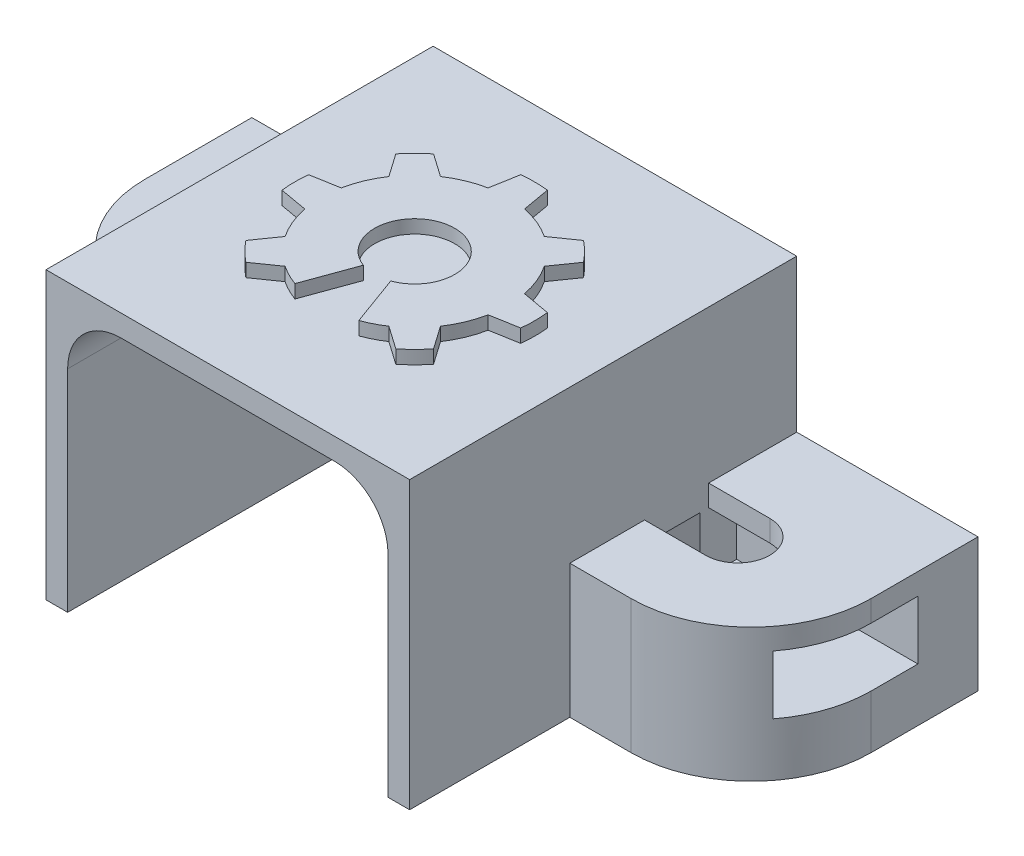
ISO-10303-21;
HEADER;
FILE_DESCRIPTION(('STEP AP214'),'2;1');
FILE_NAME('part.step','',(''),(''),'','','');
FILE_SCHEMA(('AUTOMOTIVE_DESIGN { 1 0 10303 214 1 1 1 1 }'));
ENDSEC;
DATA;
#1=APPLICATION_CONTEXT('core data for automotive mechanical design processes');
#2=APPLICATION_PROTOCOL_DEFINITION('international standard','automotive_design',2000,#1);
#3=PRODUCT_CONTEXT('',#1,'mechanical');
#4=PRODUCT('Part','Part','',(#3));
#5=PRODUCT_RELATED_PRODUCT_CATEGORY('part','',(#4));
#6=PRODUCT_DEFINITION_FORMATION('','',#4);
#7=PRODUCT_DEFINITION_CONTEXT('part definition',#1,'design');
#8=PRODUCT_DEFINITION('design','',#6,#7);
#9=PRODUCT_DEFINITION_SHAPE('','',#8);
#10=(LENGTH_UNIT() NAMED_UNIT(*) SI_UNIT(.MILLI.,.METRE.));
#11=(NAMED_UNIT(*) PLANE_ANGLE_UNIT() SI_UNIT($,.RADIAN.));
#12=(NAMED_UNIT(*) SI_UNIT($,.STERADIAN.) SOLID_ANGLE_UNIT());
#13=UNCERTAINTY_MEASURE_WITH_UNIT(LENGTH_MEASURE(1.E-05),#10,'distance_accuracy_value','');
#14=(GEOMETRIC_REPRESENTATION_CONTEXT(3) GLOBAL_UNCERTAINTY_ASSIGNED_CONTEXT((#13)) GLOBAL_UNIT_ASSIGNED_CONTEXT((#10,
#11,#12)) REPRESENTATION_CONTEXT('',''));
#15=CARTESIAN_POINT('',(0.,0.,0.));
#16=DIRECTION('',(0.,0.,1.));
#17=DIRECTION('',(1.,0.,0.));
#18=AXIS2_PLACEMENT_3D('',#15,#16,#17);
#19=CARTESIAN_POINT('',(-6.81,5.,-3.8));
#20=DIRECTION('',(0.,0.,1.));
#21=DIRECTION('',(1.,0.,0.));
#22=AXIS2_PLACEMENT_3D('',#19,#20,#21);
#23=PLANE('',#22);
#24=DIRECTION('',(0.,-1.,0.));
#25=VECTOR('',#24,1.);
#26=CARTESIAN_POINT('',(-6.81,5.,-3.8));
#27=LINE('',#26,#25);
#28=CARTESIAN_POINT('',(-6.81,5.,-3.8));
#29=VERTEX_POINT('',#28);
#30=CARTESIAN_POINT('',(-6.81,4.2,-3.8));
#31=VERTEX_POINT('',#30);
#32=EDGE_CURVE('E1021',#29,#31,#27,.T.);
#33=ORIENTED_EDGE('',*,*,#32,.T.);
#34=DIRECTION('',(-1.,0.,0.));
#35=VECTOR('',#34,1.);
#36=CARTESIAN_POINT('',(-6.81,4.19999999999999,-3.8));
#37=LINE('',#36,#35);
#38=CARTESIAN_POINT('',(-9.1,4.19999999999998,-3.8));
#39=VERTEX_POINT('',#38);
#40=EDGE_CURVE('E915',#31,#39,#37,.T.);
#41=ORIENTED_EDGE('',*,*,#40,.T.);
#42=DIRECTION('',(0.,-1.,0.));
#43=VECTOR('',#42,1.);
#44=CARTESIAN_POINT('',(-9.1,5.,-3.8));
#45=LINE('',#44,#43);
#46=CARTESIAN_POINT('',(-9.1,5.,-3.8));
#47=VERTEX_POINT('',#46);
#48=EDGE_CURVE('E1017',#47,#39,#45,.T.);
#49=ORIENTED_EDGE('',*,*,#48,.F.);
#50=DIRECTION('',(-1.,0.,0.));
#51=VECTOR('',#50,1.);
#52=CARTESIAN_POINT('',(-6.81,5.,-3.8));
#53=LINE('',#52,#51);
#54=EDGE_CURVE('E975',#29,#47,#53,.T.);
#55=ORIENTED_EDGE('',*,*,#54,.F.);
#56=EDGE_LOOP('',(#33,#41,#49,#55));
#57=FACE_BOUND('',#56,.T.);
#58=ADVANCED_FACE('F33',(#57),#23,.F.);
#59=CARTESIAN_POINT('',(-6.81,5.,-6.2));
#60=DIRECTION('',(0.,0.,-1.));
#61=DIRECTION('',(-1.,0.,0.));
#62=AXIS2_PLACEMENT_3D('',#59,#60,#61);
#63=PLANE('',#62);
#64=DIRECTION('',(1.,0.,0.));
#65=VECTOR('',#64,1.);
#66=CARTESIAN_POINT('',(-6.81,4.19999999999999,-6.2));
#67=LINE('',#66,#65);
#68=CARTESIAN_POINT('',(-9.1,4.19999999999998,-6.2));
#69=VERTEX_POINT('',#68);
#70=CARTESIAN_POINT('',(-6.81,4.2,-6.2));
#71=VERTEX_POINT('',#70);
#72=EDGE_CURVE('E11',#69,#71,#67,.T.);
#73=ORIENTED_EDGE('',*,*,#72,.T.);
#74=DIRECTION('',(0.,-1.,0.));
#75=VECTOR('',#74,1.);
#76=CARTESIAN_POINT('',(-6.81,5.,-6.2));
#77=LINE('',#76,#75);
#78=CARTESIAN_POINT('',(-6.81,5.,-6.2));
#79=VERTEX_POINT('',#78);
#80=EDGE_CURVE('E580',#79,#71,#77,.T.);
#81=ORIENTED_EDGE('',*,*,#80,.F.);
#82=DIRECTION('',(1.,0.,0.));
#83=VECTOR('',#82,1.);
#84=CARTESIAN_POINT('',(-6.81,5.,-6.2));
#85=LINE('',#84,#83);
#86=CARTESIAN_POINT('',(-9.1,5.,-6.2));
#87=VERTEX_POINT('',#86);
#88=EDGE_CURVE('E979',#87,#79,#85,.T.);
#89=ORIENTED_EDGE('',*,*,#88,.F.);
#90=DIRECTION('',(0.,-1.,0.));
#91=VECTOR('',#90,1.);
#92=CARTESIAN_POINT('',(-9.1,5.,-6.2));
#93=LINE('',#92,#91);
#94=EDGE_CURVE('E1013',#87,#69,#93,.T.);
#95=ORIENTED_EDGE('',*,*,#94,.T.);
#96=EDGE_LOOP('',(#73,#81,#89,#95));
#97=FACE_BOUND('',#96,.T.);
#98=ADVANCED_FACE('F1399',(#97),#63,.F.);
#99=CARTESIAN_POINT('',(6.81,5.,-6.2));
#100=DIRECTION('',(0.,0.,-1.));
#101=DIRECTION('',(-1.,0.,0.));
#102=AXIS2_PLACEMENT_3D('',#99,#100,#101);
#103=PLANE('',#102);
#104=DIRECTION('',(1.,0.,0.));
#105=VECTOR('',#104,1.);
#106=CARTESIAN_POINT('',(6.81,1.99999999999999,-6.2));
#107=LINE('',#106,#105);
#108=CARTESIAN_POINT('',(6.81,2.,-6.2));
#109=VERTEX_POINT('',#108);
#110=CARTESIAN_POINT('',(9.1,1.99999999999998,-6.2));
#111=VERTEX_POINT('',#110);
#112=EDGE_CURVE('E948',#109,#111,#107,.T.);
#113=ORIENTED_EDGE('',*,*,#112,.F.);
#114=DIRECTION('',(0.,-1.,0.));
#115=VECTOR('',#114,1.);
#116=CARTESIAN_POINT('',(6.81,5.,-6.2));
#117=LINE('',#116,#115);
#118=CARTESIAN_POINT('',(6.81,0.,-6.2));
#119=VERTEX_POINT('',#118);
#120=EDGE_CURVE('E1086',#109,#119,#117,.T.);
#121=ORIENTED_EDGE('',*,*,#120,.T.);
#122=DIRECTION('',(1.,0.,0.));
#123=VECTOR('',#122,1.);
#124=CARTESIAN_POINT('',(6.81,0.,-6.2));
#125=LINE('',#124,#123);
#126=CARTESIAN_POINT('',(9.1,0.,-6.2));
#127=VERTEX_POINT('',#126);
#128=EDGE_CURVE('E1059',#119,#127,#125,.T.);
#129=ORIENTED_EDGE('',*,*,#128,.T.);
#130=DIRECTION('',(0.,-1.,0.));
#131=VECTOR('',#130,1.);
#132=CARTESIAN_POINT('',(9.1,5.,-6.2));
#133=LINE('',#132,#131);
#134=EDGE_CURVE('E1082',#111,#127,#133,.T.);
#135=ORIENTED_EDGE('',*,*,#134,.F.);
#136=EDGE_LOOP('',(#113,#121,#129,#135));
#137=FACE_BOUND('',#136,.T.);
#138=ADVANCED_FACE('F1294',(#137),#103,.F.);
#139=CARTESIAN_POINT('',(6.81,5.,-3.8));
#140=DIRECTION('',(0.,0.,1.));
#141=DIRECTION('',(1.,0.,0.));
#142=AXIS2_PLACEMENT_3D('',#139,#140,#141);
#143=PLANE('',#142);
#144=DIRECTION('',(0.,-1.,0.));
#145=VECTOR('',#144,1.);
#146=CARTESIAN_POINT('',(6.81,5.,-3.8));
#147=LINE('',#146,#145);
#148=CARTESIAN_POINT('',(6.81,2.,-3.8));
#149=VERTEX_POINT('',#148);
#150=CARTESIAN_POINT('',(6.81,0.,-3.8));
#151=VERTEX_POINT('',#150);
#152=EDGE_CURVE('E1074',#149,#151,#147,.T.);
#153=ORIENTED_EDGE('',*,*,#152,.F.);
#154=DIRECTION('',(-1.,0.,0.));
#155=VECTOR('',#154,1.);
#156=CARTESIAN_POINT('',(6.80999999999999,1.99999999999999,-3.8));
#157=LINE('',#156,#155);
#158=CARTESIAN_POINT('',(9.1,1.99999999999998,-3.8));
#159=VERTEX_POINT('',#158);
#160=EDGE_CURVE('E1170',#159,#149,#157,.T.);
#161=ORIENTED_EDGE('',*,*,#160,.F.);
#162=DIRECTION('',(0.,-1.,0.));
#163=VECTOR('',#162,1.);
#164=CARTESIAN_POINT('',(9.1,5.,-3.8));
#165=LINE('',#164,#163);
#166=CARTESIAN_POINT('',(9.1,0.,-3.8));
#167=VERTEX_POINT('',#166);
#168=EDGE_CURVE('E1078',#159,#167,#165,.T.);
#169=ORIENTED_EDGE('',*,*,#168,.T.);
#170=DIRECTION('',(-1.,0.,0.));
#171=VECTOR('',#170,1.);
#172=CARTESIAN_POINT('',(6.81,0.,-3.8));
#173=LINE('',#172,#171);
#174=EDGE_CURVE('E1065',#167,#151,#173,.T.);
#175=ORIENTED_EDGE('',*,*,#174,.T.);
#176=EDGE_LOOP('',(#153,#161,#169,#175));
#177=FACE_BOUND('',#176,.T.);
#178=ADVANCED_FACE('F1283',(#177),#143,.F.);
#179=CARTESIAN_POINT('',(-6.81,10.71,5.));
#180=DIRECTION('',(0.,-1.,0.));
#181=DIRECTION('',(1.,0.,0.));
#182=AXIS2_PLACEMENT_3D('',#179,#180,#181);
#183=PLANE('',#182);
#184=DIRECTION('',(0.,0.,-1.));
#185=VECTOR('',#184,1.);
#186=CARTESIAN_POINT('',(6.81,10.71,5.));
#187=LINE('',#186,#185);
#188=CARTESIAN_POINT('',(6.81,10.71,5.));
#189=VERTEX_POINT('',#188);
#190=CARTESIAN_POINT('',(6.81,10.71,-9.5));
#191=VERTEX_POINT('',#190);
#192=EDGE_CURVE('E1200',#189,#191,#187,.T.);
#193=ORIENTED_EDGE('',*,*,#192,.T.);
#194=DIRECTION('',(1.,0.,0.));
#195=VECTOR('',#194,1.);
#196=CARTESIAN_POINT('',(6.81,10.71,-9.5));
#197=LINE('',#196,#195);
#198=CARTESIAN_POINT('',(-6.81,10.71,-9.5));
#199=VERTEX_POINT('',#198);
#200=EDGE_CURVE('E1103',#199,#191,#197,.T.);
#201=ORIENTED_EDGE('',*,*,#200,.F.);
#202=DIRECTION('',(0.,0.,-1.));
#203=VECTOR('',#202,1.);
#204=CARTESIAN_POINT('',(-6.81,10.71,5.));
#205=LINE('',#204,#203);
#206=CARTESIAN_POINT('',(-6.81,10.71,5.));
#207=VERTEX_POINT('',#206);
#208=EDGE_CURVE('E1193',#207,#199,#205,.T.);
#209=ORIENTED_EDGE('',*,*,#208,.F.);
#210=DIRECTION('',(-1.,0.,0.));
#211=VECTOR('',#210,1.);
#212=CARTESIAN_POINT('',(-6.81,10.71,5.));
#213=LINE('',#212,#211);
#214=EDGE_CURVE('E1316',#189,#207,#213,.T.);
#215=ORIENTED_EDGE('',*,*,#214,.F.);
#216=EDGE_LOOP('',(#193,#201,#209,#215));
#217=FACE_BOUND('',#216,.T.);
#218=CARTESIAN_POINT('',(0.,10.71,-2.));
#219=DIRECTION('',(0.,-1.,0.));
#220=DIRECTION('',(-1.,0.,0.));
#221=AXIS2_PLACEMENT_3D('',#218,#219,#220);
#222=CIRCLE('',#221,1.5);
#223=CARTESIAN_POINT('',(-0.513030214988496,10.71,-0.590461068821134));
#224=VERTEX_POINT('',#223);
#225=CARTESIAN_POINT('',(0.513030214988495,10.71,-0.590461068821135));
#226=VERTEX_POINT('',#225);
#227=EDGE_CURVE('E633',#224,#226,#222,.T.);
#228=ORIENTED_EDGE('',*,*,#227,.F.);
#229=DIRECTION('',(0.342020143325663,0.,-0.93969262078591));
#230=VECTOR('',#229,1.);
#231=CARTESIAN_POINT('',(-0.513030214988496,10.71,-0.590461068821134));
#232=LINE('',#231,#230);
#233=CARTESIAN_POINT('',(-1.19707050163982,10.71,1.28892417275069));
#234=VERTEX_POINT('',#233);
#235=EDGE_CURVE('E638',#234,#224,#232,.T.);
#236=ORIENTED_EDGE('',*,*,#235,.F.);
#237=CARTESIAN_POINT('',(0.,10.71,-2.));
#238=DIRECTION('',(0.,1.,0.));
#239=DIRECTION('',(1.,0.,0.));
#240=AXIS2_PLACEMENT_3D('',#237,#238,#239);
#241=CIRCLE('',#240,3.5);
#242=CARTESIAN_POINT('',(-1.94409522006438,10.71,0.910411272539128));
#243=VERTEX_POINT('',#242);
#244=EDGE_CURVE('E790',#243,#234,#241,.T.);
#245=ORIENTED_EDGE('',*,*,#244,.F.);
#246=DIRECTION('',(0.819152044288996,0.,-0.57357643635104));
#247=VECTOR('',#246,1.);
#248=CARTESIAN_POINT('',(-1.94409522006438,10.71,0.910411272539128));
#249=LINE('',#248,#247);
#250=CARTESIAN_POINT('',(-2.80872426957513,10.71,1.51583105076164));
#251=VERTEX_POINT('',#250);
#252=EDGE_CURVE('E787',#251,#243,#249,.T.);
#253=ORIENTED_EDGE('',*,*,#252,.F.);
#254=CARTESIAN_POINT('',(0.,10.71,-2.));
#255=DIRECTION('',(0.,1.,0.));
#256=DIRECTION('',(1.,0.,0.));
#257=AXIS2_PLACEMENT_3D('',#254,#255,#256);
#258=CIRCLE('',#257,4.5);
#259=CARTESIAN_POINT('',(-3.51583105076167,10.71,0.808724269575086));
#260=VERTEX_POINT('',#259);
#261=EDGE_CURVE('E784',#260,#251,#258,.T.);
#262=ORIENTED_EDGE('',*,*,#261,.F.);
#263=DIRECTION('',(-0.573576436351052,0.,0.819152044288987));
#264=VECTOR('',#263,1.);
#265=CARTESIAN_POINT('',(-2.91041127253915,10.71,-0.0559047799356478));
#266=LINE('',#265,#264);
#267=CARTESIAN_POINT('',(-2.91041127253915,10.71,-0.055904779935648));
#268=VERTEX_POINT('',#267);
#269=EDGE_CURVE('E781',#268,#260,#266,.T.);
#270=ORIENTED_EDGE('',*,*,#269,.F.);
#271=CARTESIAN_POINT('',(0.,10.71,-2.));
#272=DIRECTION('',(0.,1.,0.));
#273=DIRECTION('',(1.,0.,0.));
#274=AXIS2_PLACEMENT_3D('',#271,#272,#273);
#275=CIRCLE('',#274,3.5);
#276=CARTESIAN_POINT('',(-3.43265446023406,10.71,-1.31671136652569));
#277=VERTEX_POINT('',#276);
#278=EDGE_CURVE('E778',#277,#268,#275,.T.);
#279=ORIENTED_EDGE('',*,*,#278,.F.);
#280=DIRECTION('',(0.984807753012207,0.,0.173648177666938));
#281=VECTOR('',#280,1.);
#282=CARTESIAN_POINT('',(-3.43265446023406,10.71,-1.31671136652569));
#283=LINE('',#282,#281);
#284=CARTESIAN_POINT('',(-4.47213595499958,10.71,-1.50000000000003));
#285=VERTEX_POINT('',#284);
#286=EDGE_CURVE('E775',#285,#277,#283,.T.);
#287=ORIENTED_EDGE('',*,*,#286,.F.);
#288=CARTESIAN_POINT('',(0.,10.71,-2.));
#289=DIRECTION('',(0.,1.,0.));
#290=DIRECTION('',(1.,0.,0.));
#291=AXIS2_PLACEMENT_3D('',#288,#289,#290);
#292=CIRCLE('',#291,4.5);
#293=CARTESIAN_POINT('',(-4.47213595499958,10.71,-2.50000000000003));
#294=VERTEX_POINT('',#293);
#295=EDGE_CURVE('E772',#294,#285,#292,.T.);
#296=ORIENTED_EDGE('',*,*,#295,.F.);
#297=DIRECTION('',(-0.984807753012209,0.,0.173648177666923));
#298=VECTOR('',#297,1.);
#299=CARTESIAN_POINT('',(-3.43265446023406,10.71,-2.68328863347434));
#300=LINE('',#299,#298);
#301=CARTESIAN_POINT('',(-3.43265446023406,10.71,-2.68328863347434));
#302=VERTEX_POINT('',#301);
#303=EDGE_CURVE('E769',#302,#294,#300,.T.);
#304=ORIENTED_EDGE('',*,*,#303,.F.);
#305=CARTESIAN_POINT('',(0.,10.71,-2.));
#306=DIRECTION('',(0.,1.,0.));
#307=DIRECTION('',(1.,0.,0.));
#308=AXIS2_PLACEMENT_3D('',#305,#306,#307);
#309=CIRCLE('',#308,3.5);
#310=CARTESIAN_POINT('',(-2.91041127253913,10.71,-3.94409522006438));
#311=VERTEX_POINT('',#310);
#312=EDGE_CURVE('E766',#311,#302,#309,.T.);
#313=ORIENTED_EDGE('',*,*,#312,.F.);
#314=DIRECTION('',(0.573576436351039,0.,0.819152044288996));
#315=VECTOR('',#314,1.);
#316=CARTESIAN_POINT('',(-2.91041127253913,10.71,-3.94409522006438));
#317=LINE('',#316,#315);
#318=CARTESIAN_POINT('',(-3.51583105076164,10.71,-4.80872426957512));
#319=VERTEX_POINT('',#318);
#320=EDGE_CURVE('E763',#319,#311,#317,.T.);
#321=ORIENTED_EDGE('',*,*,#320,.F.);
#322=CARTESIAN_POINT('',(0.,10.71,-2.));
#323=DIRECTION('',(0.,1.,0.));
#324=DIRECTION('',(1.,0.,0.));
#325=AXIS2_PLACEMENT_3D('',#322,#323,#324);
#326=CIRCLE('',#325,4.5);
#327=CARTESIAN_POINT('',(-2.80872426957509,10.71,-5.51583105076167));
#328=VERTEX_POINT('',#327);
#329=EDGE_CURVE('E760',#328,#319,#326,.T.);
#330=ORIENTED_EDGE('',*,*,#329,.F.);
#331=DIRECTION('',(-0.819152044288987,0.,-0.573576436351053));
#332=VECTOR('',#331,1.);
#333=CARTESIAN_POINT('',(-1.94409522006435,10.71,-4.91041127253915));
#334=LINE('',#333,#332);
#335=CARTESIAN_POINT('',(-1.94409522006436,10.71,-4.91041127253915));
#336=VERTEX_POINT('',#335);
#337=EDGE_CURVE('E757',#336,#328,#334,.T.);
#338=ORIENTED_EDGE('',*,*,#337,.F.);
#339=CARTESIAN_POINT('',(0.,10.71,-2.));
#340=DIRECTION('',(0.,1.,0.));
#341=DIRECTION('',(1.,0.,0.));
#342=AXIS2_PLACEMENT_3D('',#339,#340,#341);
#343=CIRCLE('',#342,3.5);
#344=CARTESIAN_POINT('',(-0.68328863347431,10.71,-5.43265446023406));
#345=VERTEX_POINT('',#344);
#346=EDGE_CURVE('E754',#345,#336,#343,.T.);
#347=ORIENTED_EDGE('',*,*,#346,.F.);
#348=DIRECTION('',(-0.173648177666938,0.,0.984807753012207));
#349=VECTOR('',#348,1.);
#350=CARTESIAN_POINT('',(-0.68328863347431,10.71,-5.43265446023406));
#351=LINE('',#350,#349);
#352=CARTESIAN_POINT('',(-0.499999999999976,10.71,-6.47213595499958));
#353=VERTEX_POINT('',#352);
#354=EDGE_CURVE('E751',#353,#345,#351,.T.);
#355=ORIENTED_EDGE('',*,*,#354,.F.);
#356=CARTESIAN_POINT('',(0.,10.71,-2.));
#357=DIRECTION('',(0.,1.,0.));
#358=DIRECTION('',(1.,0.,0.));
#359=AXIS2_PLACEMENT_3D('',#356,#357,#358);
#360=CIRCLE('',#359,4.5);
#361=CARTESIAN_POINT('',(0.500000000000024,10.71,-6.47213595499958));
#362=VERTEX_POINT('',#361);
#363=EDGE_CURVE('E748',#362,#353,#360,.T.);
#364=ORIENTED_EDGE('',*,*,#363,.F.);
#365=DIRECTION('',(-0.173648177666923,0.,-0.984807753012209));
#366=VECTOR('',#365,1.);
#367=CARTESIAN_POINT('',(0.683288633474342,10.71,-5.43265446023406));
#368=LINE('',#367,#366);
#369=CARTESIAN_POINT('',(0.683288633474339,10.71,-5.43265446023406));
#370=VERTEX_POINT('',#369);
#371=EDGE_CURVE('E745',#370,#362,#368,.T.);
#372=ORIENTED_EDGE('',*,*,#371,.F.);
#373=CARTESIAN_POINT('',(0.,10.71,-2.));
#374=DIRECTION('',(0.,1.,0.));
#375=DIRECTION('',(1.,0.,0.));
#376=AXIS2_PLACEMENT_3D('',#373,#374,#375);
#377=CIRCLE('',#376,3.5);
#378=CARTESIAN_POINT('',(1.94409522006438,10.71,-4.91041127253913));
#379=VERTEX_POINT('',#378);
#380=EDGE_CURVE('E742',#379,#370,#377,.T.);
#381=ORIENTED_EDGE('',*,*,#380,.F.);
#382=DIRECTION('',(-0.819152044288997,0.,0.573576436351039));
#383=VECTOR('',#382,1.);
#384=CARTESIAN_POINT('',(1.94409522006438,10.71,-4.91041127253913));
#385=LINE('',#384,#383);
#386=CARTESIAN_POINT('',(2.80872426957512,10.71,-5.51583105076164));
#387=VERTEX_POINT('',#386);
#388=EDGE_CURVE('E739',#387,#379,#385,.T.);
#389=ORIENTED_EDGE('',*,*,#388,.F.);
#390=CARTESIAN_POINT('',(0.,10.71,-2.));
#391=DIRECTION('',(0.,1.,0.));
#392=DIRECTION('',(1.,0.,0.));
#393=AXIS2_PLACEMENT_3D('',#390,#391,#392);
#394=CIRCLE('',#393,4.5);
#395=CARTESIAN_POINT('',(3.51583105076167,10.71,-4.80872426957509));
#396=VERTEX_POINT('',#395);
#397=EDGE_CURVE('E736',#396,#387,#394,.T.);
#398=ORIENTED_EDGE('',*,*,#397,.F.);
#399=DIRECTION('',(0.573576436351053,0.,-0.819152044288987));
#400=VECTOR('',#399,1.);
#401=CARTESIAN_POINT('',(2.91041127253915,10.71,-3.94409522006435));
#402=LINE('',#401,#400);
#403=CARTESIAN_POINT('',(2.91041127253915,10.71,-3.94409522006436));
#404=VERTEX_POINT('',#403);
#405=EDGE_CURVE('E733',#404,#396,#402,.T.);
#406=ORIENTED_EDGE('',*,*,#405,.F.);
#407=CARTESIAN_POINT('',(0.,10.71,-2.));
#408=DIRECTION('',(0.,1.,0.));
#409=DIRECTION('',(1.,0.,0.));
#410=AXIS2_PLACEMENT_3D('',#407,#408,#409);
#411=CIRCLE('',#410,3.5);
#412=CARTESIAN_POINT('',(3.43265446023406,10.71,-2.68328863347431));
#413=VERTEX_POINT('',#412);
#414=EDGE_CURVE('E730',#413,#404,#411,.T.);
#415=ORIENTED_EDGE('',*,*,#414,.F.);
#416=DIRECTION('',(-0.984807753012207,0.,-0.173648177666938));
#417=VECTOR('',#416,1.);
#418=CARTESIAN_POINT('',(3.43265446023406,10.71,-2.68328863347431));
#419=LINE('',#418,#417);
#420=CARTESIAN_POINT('',(4.47213595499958,10.71,-2.49999999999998));
#421=VERTEX_POINT('',#420);
#422=EDGE_CURVE('E727',#421,#413,#419,.T.);
#423=ORIENTED_EDGE('',*,*,#422,.F.);
#424=CARTESIAN_POINT('',(0.,10.71,-2.));
#425=DIRECTION('',(0.,1.,0.));
#426=DIRECTION('',(1.,0.,0.));
#427=AXIS2_PLACEMENT_3D('',#424,#425,#426);
#428=CIRCLE('',#427,4.5);
#429=CARTESIAN_POINT('',(4.47213595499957,10.71,-1.49999999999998));
#430=VERTEX_POINT('',#429);
#431=EDGE_CURVE('E724',#430,#421,#428,.T.);
#432=ORIENTED_EDGE('',*,*,#431,.F.);
#433=DIRECTION('',(0.984807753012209,0.,-0.173648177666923));
#434=VECTOR('',#433,1.);
#435=CARTESIAN_POINT('',(3.43265446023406,10.71,-1.31671136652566));
#436=LINE('',#435,#434);
#437=CARTESIAN_POINT('',(3.43265446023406,10.71,-1.31671136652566));
#438=VERTEX_POINT('',#437);
#439=EDGE_CURVE('E721',#438,#430,#436,.T.);
#440=ORIENTED_EDGE('',*,*,#439,.F.);
#441=CARTESIAN_POINT('',(0.,10.71,-2.));
#442=DIRECTION('',(0.,1.,0.));
#443=DIRECTION('',(1.,0.,0.));
#444=AXIS2_PLACEMENT_3D('',#441,#442,#443);
#445=CIRCLE('',#444,3.5);
#446=CARTESIAN_POINT('',(2.91041127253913,10.71,-0.0559047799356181));
#447=VERTEX_POINT('',#446);
#448=EDGE_CURVE('E718',#447,#438,#445,.T.);
#449=ORIENTED_EDGE('',*,*,#448,.F.);
#450=DIRECTION('',(-0.573576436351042,0.,-0.819152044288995));
#451=VECTOR('',#450,1.);
#452=CARTESIAN_POINT('',(2.91041127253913,10.71,-0.0559047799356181));
#453=LINE('',#452,#451);
#454=CARTESIAN_POINT('',(3.51583105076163,10.71,0.808724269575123));
#455=VERTEX_POINT('',#454);
#456=EDGE_CURVE('E715',#455,#447,#453,.T.);
#457=ORIENTED_EDGE('',*,*,#456,.F.);
#458=CARTESIAN_POINT('',(0.,10.71,-2.));
#459=DIRECTION('',(0.,1.,0.));
#460=DIRECTION('',(1.,0.,0.));
#461=AXIS2_PLACEMENT_3D('',#458,#459,#460);
#462=CIRCLE('',#461,4.5);
#463=CARTESIAN_POINT('',(2.80872426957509,10.71,1.51583105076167));
#464=VERTEX_POINT('',#463);
#465=EDGE_CURVE('E712',#464,#455,#462,.T.);
#466=ORIENTED_EDGE('',*,*,#465,.F.);
#467=DIRECTION('',(0.819152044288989,0.,0.57357643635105));
#468=VECTOR('',#467,1.);
#469=CARTESIAN_POINT('',(1.94409522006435,10.71,0.910411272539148));
#470=LINE('',#469,#468);
#471=CARTESIAN_POINT('',(1.94409522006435,10.71,0.910411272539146));
#472=VERTEX_POINT('',#471);
#473=EDGE_CURVE('E709',#472,#464,#470,.T.);
#474=ORIENTED_EDGE('',*,*,#473,.F.);
#475=CARTESIAN_POINT('',(0.,10.71,-2.));
#476=DIRECTION('',(0.,1.,0.));
#477=DIRECTION('',(1.,0.,0.));
#478=AXIS2_PLACEMENT_3D('',#475,#476,#477);
#479=CIRCLE('',#478,3.5);
#480=CARTESIAN_POINT('',(1.19707050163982,10.71,1.28892417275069));
#481=VERTEX_POINT('',#480);
#482=EDGE_CURVE('E706',#481,#472,#479,.T.);
#483=ORIENTED_EDGE('',*,*,#482,.F.);
#484=DIRECTION('',(0.342020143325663,0.,0.93969262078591));
#485=VECTOR('',#484,1.);
#486=CARTESIAN_POINT('',(0.513030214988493,10.71,-0.590461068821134));
#487=LINE('',#486,#485);
#488=EDGE_CURVE('E703',#226,#481,#487,.T.);
#489=ORIENTED_EDGE('',*,*,#488,.F.);
#490=EDGE_LOOP('',(#228,#236,#245,#253,#262,#270,#279,#287,#296,#304,#313,#321,#330,#338,#347,
#355,#364,#372,#381,#389,#398,#406,#415,#423,#432,#440,#449,#457,#466,#474,#483,#489));
#491=FACE_BOUND('',#490,.T.);
#492=ADVANCED_FACE('F1312',(#217,#491),#183,.F.);
#493=CARTESIAN_POINT('',(-9.1,5.,-5.));
#494=DIRECTION('',(0.,-1.,0.));
#495=DIRECTION('',(0.,0.,-1.));
#496=AXIS2_PLACEMENT_3D('',#493,#494,#495);
#497=CYLINDRICAL_SURFACE('',#496,1.2);
#498=CARTESIAN_POINT('',(-9.1,1.99999999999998,-5.));
#499=DIRECTION('',(0.,1.,0.));
#500=DIRECTION('',(-1.,0.,0.));
#501=AXIS2_PLACEMENT_3D('',#498,#499,#500);
#502=CIRCLE('',#501,1.2);
#503=CARTESIAN_POINT('',(-9.1,1.99999999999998,-3.8));
#504=VERTEX_POINT('',#503);
#505=CARTESIAN_POINT('',(-9.1,1.99999999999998,-6.2));
#506=VERTEX_POINT('',#505);
#507=EDGE_CURVE('E906',#504,#506,#502,.F.);
#508=ORIENTED_EDGE('',*,*,#507,.F.);
#509=CARTESIAN_POINT('',(-9.1,0.,-3.8));
#510=VERTEX_POINT('',#509);
#511=EDGE_CURVE('E1016',#504,#510,#45,.T.);
#512=ORIENTED_EDGE('',*,*,#511,.T.);
#513=CARTESIAN_POINT('',(-9.1,0.,-5.));
#514=DIRECTION('',(0.,-1.,0.));
#515=DIRECTION('',(0.,0.,1.));
#516=AXIS2_PLACEMENT_3D('',#513,#514,#515);
#517=CIRCLE('',#516,1.2);
#518=CARTESIAN_POINT('',(-9.1,0.,-6.2));
#519=VERTEX_POINT('',#518);
#520=EDGE_CURVE('E996',#510,#519,#517,.T.);
#521=ORIENTED_EDGE('',*,*,#520,.T.);
#522=EDGE_CURVE('E1012',#506,#519,#93,.T.);
#523=ORIENTED_EDGE('',*,*,#522,.F.);
#524=EDGE_LOOP('',(#508,#512,#521,#523));
#525=FACE_BOUND('',#524,.T.);
#526=ADVANCED_FACE('F1407',(#525),#497,.F.);
#527=CARTESIAN_POINT('',(9.1,5.,-5.));
#528=DIRECTION('',(0.,-1.,0.));
#529=DIRECTION('',(0.,0.,-1.));
#530=AXIS2_PLACEMENT_3D('',#527,#528,#529);
#531=CYLINDRICAL_SURFACE('',#530,1.2);
#532=CARTESIAN_POINT('',(9.1,1.99999999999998,-5.));
#533=DIRECTION('',(0.,1.,0.));
#534=DIRECTION('',(-1.,0.,0.));
#535=AXIS2_PLACEMENT_3D('',#532,#533,#534);
#536=CIRCLE('',#535,1.2);
#537=EDGE_CURVE('E946',#111,#159,#536,.F.);
#538=ORIENTED_EDGE('',*,*,#537,.F.);
#539=ORIENTED_EDGE('',*,*,#134,.T.);
#540=CARTESIAN_POINT('',(9.1,0.,-5.));
#541=DIRECTION('',(0.,-1.,0.));
#542=DIRECTION('',(0.,0.,-1.));
#543=AXIS2_PLACEMENT_3D('',#540,#541,#542);
#544=CIRCLE('',#543,1.2);
#545=EDGE_CURVE('E1062',#127,#167,#544,.T.);
#546=ORIENTED_EDGE('',*,*,#545,.T.);
#547=ORIENTED_EDGE('',*,*,#168,.F.);
#548=EDGE_LOOP('',(#538,#539,#546,#547));
#549=FACE_BOUND('',#548,.T.);
#550=ADVANCED_FACE('F1657',(#549),#531,.F.);
#551=CARTESIAN_POINT('',(-6.81,10.71,5.));
#552=DIRECTION('',(1.,0.,0.));
#553=DIRECTION('',(0.,1.,0.));
#554=AXIS2_PLACEMENT_3D('',#551,#552,#553);
#555=PLANE('',#554);
#556=DIRECTION('',(0.,1.,0.));
#557=VECTOR('',#556,1.);
#558=CARTESIAN_POINT('',(-6.81,10.71,-5.88001381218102));
#559=LINE('',#558,#557);
#560=CARTESIAN_POINT('',(-6.81,1.99999999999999,-5.88001381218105));
#561=VERTEX_POINT('',#560);
#562=CARTESIAN_POINT('',(-6.81,4.19999999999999,-5.88001381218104));
#563=VERTEX_POINT('',#562);
#564=EDGE_CURVE('E921',#561,#563,#559,.T.);
#565=ORIENTED_EDGE('',*,*,#564,.T.);
#566=DIRECTION('',(0.,0.,1.));
#567=VECTOR('',#566,1.);
#568=CARTESIAN_POINT('',(-6.81,4.19999999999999,5.));
#569=LINE('',#568,#567);
#570=CARTESIAN_POINT('',(-6.81,4.19999999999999,-4.11998618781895));
#571=VERTEX_POINT('',#570);
#572=EDGE_CURVE('E918',#563,#571,#569,.T.);
#573=ORIENTED_EDGE('',*,*,#572,.T.);
#574=DIRECTION('',(0.,-1.,0.));
#575=VECTOR('',#574,1.);
#576=CARTESIAN_POINT('',(-6.81,10.71,-4.11998618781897));
#577=LINE('',#576,#575);
#578=CARTESIAN_POINT('',(-6.81,1.99999999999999,-4.11998618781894));
#579=VERTEX_POINT('',#578);
#580=EDGE_CURVE('E924',#571,#579,#577,.T.);
#581=ORIENTED_EDGE('',*,*,#580,.T.);
#582=DIRECTION('',(0.,0.,1.));
#583=VECTOR('',#582,1.);
#584=CARTESIAN_POINT('',(-6.81,1.99999999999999,5.));
#585=LINE('',#584,#583);
#586=EDGE_CURVE('E910',#561,#579,#585,.T.);
#587=ORIENTED_EDGE('',*,*,#586,.F.);
#588=EDGE_LOOP('',(#565,#573,#581,#587));
#589=FACE_BOUND('',#588,.T.);
#590=CARTESIAN_POINT('',(-6.81,2.,-3.8));
#591=VERTEX_POINT('',#590);
#592=CARTESIAN_POINT('',(-6.81,0.,-3.8));
#593=VERTEX_POINT('',#592);
#594=EDGE_CURVE('E1020',#591,#593,#27,.T.);
#595=ORIENTED_EDGE('',*,*,#594,.F.);
#596=DIRECTION('',(0.,0.,1.));
#597=VECTOR('',#596,1.);
#598=CARTESIAN_POINT('',(-6.81,2.,-7.25));
#599=LINE('',#598,#597);
#600=CARTESIAN_POINT('',(-6.81,2.,-2.75));
#601=VERTEX_POINT('',#600);
#602=EDGE_CURVE('E585',#591,#601,#599,.T.);
#603=ORIENTED_EDGE('',*,*,#602,.T.);
#604=DIRECTION('',(0.,1.,0.));
#605=VECTOR('',#604,1.);
#606=CARTESIAN_POINT('',(-6.81,2.,-2.75000000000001));
#607=LINE('',#606,#605);
#608=CARTESIAN_POINT('',(-6.81,4.2,-2.75));
#609=VERTEX_POINT('',#608);
#610=EDGE_CURVE('E597',#601,#609,#607,.T.);
#611=ORIENTED_EDGE('',*,*,#610,.T.);
#612=DIRECTION('',(0.,0.,-1.));
#613=VECTOR('',#612,1.);
#614=CARTESIAN_POINT('',(-6.81,4.2,-2.75));
#615=LINE('',#614,#613);
#616=EDGE_CURVE('E581',#609,#31,#615,.T.);
#617=ORIENTED_EDGE('',*,*,#616,.T.);
#618=ORIENTED_EDGE('',*,*,#32,.F.);
#619=DIRECTION('',(0.,0.,-1.));
#620=VECTOR('',#619,1.);
#621=CARTESIAN_POINT('',(-6.81,5.,-3.8));
#622=LINE('',#621,#620);
#623=CARTESIAN_POINT('',(-6.81,5.,-0.999999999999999));
#624=VERTEX_POINT('',#623);
#625=EDGE_CURVE('E973',#624,#29,#622,.T.);
#626=ORIENTED_EDGE('',*,*,#625,.F.);
#627=DIRECTION('',(0.,-1.,0.));
#628=VECTOR('',#627,1.);
#629=CARTESIAN_POINT('',(-6.81,5.,-0.999999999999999));
#630=LINE('',#629,#628);
#631=CARTESIAN_POINT('',(-6.81,0.,-0.999999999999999));
#632=VERTEX_POINT('',#631);
#633=EDGE_CURVE('E1024',#624,#632,#630,.T.);
#634=ORIENTED_EDGE('',*,*,#633,.T.);
#635=DIRECTION('',(0.,0.,-1.));
#636=VECTOR('',#635,1.);
#637=CARTESIAN_POINT('',(-6.81,0.,5.));
#638=LINE('',#637,#636);
#639=CARTESIAN_POINT('',(-6.81,0.,5.));
#640=VERTEX_POINT('',#639);
#641=EDGE_CURVE('E1189',#640,#632,#638,.T.);
#642=ORIENTED_EDGE('',*,*,#641,.F.);
#643=DIRECTION('',(0.,-1.,0.));
#644=VECTOR('',#643,1.);
#645=CARTESIAN_POINT('',(-6.81,10.71,5.));
#646=LINE('',#645,#644);
#647=EDGE_CURVE('E1332',#207,#640,#646,.T.);
#648=ORIENTED_EDGE('',*,*,#647,.F.);
#649=ORIENTED_EDGE('',*,*,#208,.T.);
#650=DIRECTION('',(0.,1.,0.));
#651=VECTOR('',#650,1.);
#652=CARTESIAN_POINT('',(-6.81,10.71,-9.5));
#653=LINE('',#652,#651);
#654=CARTESIAN_POINT('',(-6.81,5.,-9.5));
#655=VERTEX_POINT('',#654);
#656=EDGE_CURVE('E1100',#655,#199,#653,.T.);
#657=ORIENTED_EDGE('',*,*,#656,.F.);
#658=DIRECTION('',(0.,0.,-1.));
#659=VECTOR('',#658,1.);
#660=CARTESIAN_POINT('',(-6.81,5.,-9.5));
#661=LINE('',#660,#659);
#662=EDGE_CURVE('E981',#79,#655,#661,.T.);
#663=ORIENTED_EDGE('',*,*,#662,.F.);
#664=ORIENTED_EDGE('',*,*,#80,.T.);
#665=CARTESIAN_POINT('',(-6.81,4.2,-7.25000000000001));
#666=VERTEX_POINT('',#665);
#667=EDGE_CURVE('E562',#71,#666,#615,.T.);
#668=ORIENTED_EDGE('',*,*,#667,.T.);
#669=DIRECTION('',(0.,-1.,0.));
#670=VECTOR('',#669,1.);
#671=CARTESIAN_POINT('',(-6.81,4.2,-7.25000000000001));
#672=LINE('',#671,#670);
#673=CARTESIAN_POINT('',(-6.81,2.,-7.25000000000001));
#674=VERTEX_POINT('',#673);
#675=EDGE_CURVE('E577',#666,#674,#672,.T.);
#676=ORIENTED_EDGE('',*,*,#675,.T.);
#677=CARTESIAN_POINT('',(-6.81,2.,-6.2));
#678=VERTEX_POINT('',#677);
#679=EDGE_CURVE('E588',#674,#678,#599,.T.);
#680=ORIENTED_EDGE('',*,*,#679,.T.);
#681=CARTESIAN_POINT('',(-6.81,0.,-6.2));
#682=VERTEX_POINT('',#681);
#683=EDGE_CURVE('E1010',#678,#682,#77,.T.);
#684=ORIENTED_EDGE('',*,*,#683,.T.);
#685=EDGE_CURVE('E1186',#593,#682,#638,.T.);
#686=ORIENTED_EDGE('',*,*,#685,.F.);
#687=EDGE_LOOP('',(#595,#603,#611,#617,#618,#626,#634,#642,#648,#649,#657,#663,#664,#668,#676,
#680,#684,#686));
#688=FACE_BOUND('',#687,.T.);
#689=ADVANCED_FACE('F575',(#589,#688),#555,.F.);
#690=CARTESIAN_POINT('',(6.81,10.71,5.));
#691=DIRECTION('',(-1.,0.,0.));
#692=DIRECTION('',(0.,-1.,0.));
#693=AXIS2_PLACEMENT_3D('',#690,#691,#692);
#694=PLANE('',#693);
#695=DIRECTION('',(0.,1.,0.));
#696=VECTOR('',#695,1.);
#697=CARTESIAN_POINT('',(6.81,10.71,-5.88001381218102));
#698=LINE('',#697,#696);
#699=CARTESIAN_POINT('',(6.81,1.99999999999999,-5.88001381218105));
#700=VERTEX_POINT('',#699);
#701=CARTESIAN_POINT('',(6.81,4.19999999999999,-5.88001381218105));
#702=VERTEX_POINT('',#701);
#703=EDGE_CURVE('E964',#700,#702,#698,.T.);
#704=ORIENTED_EDGE('',*,*,#703,.F.);
#705=DIRECTION('',(0.,0.,-1.));
#706=VECTOR('',#705,1.);
#707=CARTESIAN_POINT('',(6.81,1.99999999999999,5.));
#708=LINE('',#707,#706);
#709=CARTESIAN_POINT('',(6.81,1.99999999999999,-4.11998618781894));
#710=VERTEX_POINT('',#709);
#711=EDGE_CURVE('E950',#710,#700,#708,.T.);
#712=ORIENTED_EDGE('',*,*,#711,.F.);
#713=DIRECTION('',(0.,-1.,0.));
#714=VECTOR('',#713,1.);
#715=CARTESIAN_POINT('',(6.81,10.71,-4.11998618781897));
#716=LINE('',#715,#714);
#717=CARTESIAN_POINT('',(6.81,4.19999999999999,-4.11998618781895));
#718=VERTEX_POINT('',#717);
#719=EDGE_CURVE('E961',#718,#710,#716,.T.);
#720=ORIENTED_EDGE('',*,*,#719,.F.);
#721=DIRECTION('',(0.,0.,-1.));
#722=VECTOR('',#721,1.);
#723=CARTESIAN_POINT('',(6.81,4.19999999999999,5.));
#724=LINE('',#723,#722);
#725=EDGE_CURVE('E958',#718,#702,#724,.T.);
#726=ORIENTED_EDGE('',*,*,#725,.T.);
#727=EDGE_LOOP('',(#704,#712,#720,#726));
#728=FACE_BOUND('',#727,.T.);
#729=CARTESIAN_POINT('',(6.81,5.,-3.8));
#730=VERTEX_POINT('',#729);
#731=CARTESIAN_POINT('',(6.81,4.2,-3.8));
#732=VERTEX_POINT('',#731);
#733=EDGE_CURVE('E1075',#730,#732,#147,.T.);
#734=ORIENTED_EDGE('',*,*,#733,.T.);
#735=DIRECTION('',(0.,0.,1.));
#736=VECTOR('',#735,1.);
#737=CARTESIAN_POINT('',(6.81,4.2,-2.75));
#738=LINE('',#737,#736);
#739=CARTESIAN_POINT('',(6.81,4.2,-2.75));
#740=VERTEX_POINT('',#739);
#741=EDGE_CURVE('E622',#732,#740,#738,.T.);
#742=ORIENTED_EDGE('',*,*,#741,.T.);
#743=DIRECTION('',(0.,-1.,0.));
#744=VECTOR('',#743,1.);
#745=CARTESIAN_POINT('',(6.81,4.2,-2.75));
#746=LINE('',#745,#744);
#747=CARTESIAN_POINT('',(6.81,2.,-2.75));
#748=VERTEX_POINT('',#747);
#749=EDGE_CURVE('E615',#740,#748,#746,.T.);
#750=ORIENTED_EDGE('',*,*,#749,.T.);
#751=DIRECTION('',(0.,0.,-1.));
#752=VECTOR('',#751,1.);
#753=CARTESIAN_POINT('',(6.81,2.,-2.75));
#754=LINE('',#753,#752);
#755=EDGE_CURVE('E611',#748,#149,#754,.T.);
#756=ORIENTED_EDGE('',*,*,#755,.T.);
#757=ORIENTED_EDGE('',*,*,#152,.T.);
#758=DIRECTION('',(0.,0.,-1.));
#759=VECTOR('',#758,1.);
#760=CARTESIAN_POINT('',(6.81,0.,5.));
#761=LINE('',#760,#759);
#762=EDGE_CURVE('E1202',#151,#119,#761,.T.);
#763=ORIENTED_EDGE('',*,*,#762,.T.);
#764=ORIENTED_EDGE('',*,*,#120,.F.);
#765=CARTESIAN_POINT('',(6.81,2.,-7.25));
#766=VERTEX_POINT('',#765);
#767=EDGE_CURVE('E606',#109,#766,#754,.T.);
#768=ORIENTED_EDGE('',*,*,#767,.T.);
#769=DIRECTION('',(0.,1.,0.));
#770=VECTOR('',#769,1.);
#771=CARTESIAN_POINT('',(6.81,4.2,-7.25));
#772=LINE('',#771,#770);
#773=CARTESIAN_POINT('',(6.81,4.2,-7.25));
#774=VERTEX_POINT('',#773);
#775=EDGE_CURVE('E614',#766,#774,#772,.T.);
#776=ORIENTED_EDGE('',*,*,#775,.T.);
#777=CARTESIAN_POINT('',(6.81,4.2,-6.2));
#778=VERTEX_POINT('',#777);
#779=EDGE_CURVE('E619',#774,#778,#738,.T.);
#780=ORIENTED_EDGE('',*,*,#779,.T.);
#781=CARTESIAN_POINT('',(6.81,5.,-6.2));
#782=VERTEX_POINT('',#781);
#783=EDGE_CURVE('E1087',#782,#778,#117,.T.);
#784=ORIENTED_EDGE('',*,*,#783,.F.);
#785=DIRECTION('',(0.,0.,1.));
#786=VECTOR('',#785,1.);
#787=CARTESIAN_POINT('',(6.81,5.,-9.5));
#788=LINE('',#787,#786);
#789=CARTESIAN_POINT('',(6.81,5.,-9.5));
#790=VERTEX_POINT('',#789);
#791=EDGE_CURVE('E1039',#790,#782,#788,.T.);
#792=ORIENTED_EDGE('',*,*,#791,.F.);
#793=DIRECTION('',(0.,-1.,0.));
#794=VECTOR('',#793,1.);
#795=CARTESIAN_POINT('',(6.81,10.71,-9.5));
#796=LINE('',#795,#794);
#797=EDGE_CURVE('E1106',#191,#790,#796,.T.);
#798=ORIENTED_EDGE('',*,*,#797,.F.);
#799=ORIENTED_EDGE('',*,*,#192,.F.);
#800=DIRECTION('',(0.,1.,0.));
#801=VECTOR('',#800,1.);
#802=CARTESIAN_POINT('',(6.81,10.71,5.));
#803=LINE('',#802,#801);
#804=CARTESIAN_POINT('',(6.81,0.,5.));
#805=VERTEX_POINT('',#804);
#806=EDGE_CURVE('E1317',#805,#189,#803,.T.);
#807=ORIENTED_EDGE('',*,*,#806,.F.);
#808=CARTESIAN_POINT('',(6.81,0.,-0.999999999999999));
#809=VERTEX_POINT('',#808);
#810=EDGE_CURVE('E1203',#805,#809,#761,.T.);
#811=ORIENTED_EDGE('',*,*,#810,.T.);
#812=DIRECTION('',(0.,-1.,0.));
#813=VECTOR('',#812,1.);
#814=CARTESIAN_POINT('',(6.81,5.,-0.999999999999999));
#815=LINE('',#814,#813);
#816=CARTESIAN_POINT('',(6.81,5.,-0.999999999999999));
#817=VERTEX_POINT('',#816);
#818=EDGE_CURVE('E1071',#817,#809,#815,.T.);
#819=ORIENTED_EDGE('',*,*,#818,.F.);
#820=DIRECTION('',(0.,0.,1.));
#821=VECTOR('',#820,1.);
#822=CARTESIAN_POINT('',(6.81,5.,-3.8));
#823=LINE('',#822,#821);
#824=EDGE_CURVE('E1048',#730,#817,#823,.T.);
#825=ORIENTED_EDGE('',*,*,#824,.F.);
#826=EDGE_LOOP('',(#734,#742,#750,#756,#757,#763,#764,#768,#776,#780,#784,#792,#798,#799,#807,
#811,#819,#825));
#827=FACE_BOUND('',#826,.T.);
#828=ADVANCED_FACE('F1259',(#728,#827),#694,.F.);
#829=CARTESIAN_POINT('',(6.,0.,0.));
#830=DIRECTION('',(0.,0.,-1.));
#831=DIRECTION('',(-1.,0.,0.));
#832=AXIS2_PLACEMENT_3D('',#829,#830,#831);
#833=PLANE('',#832);
#834=DIRECTION('',(0.,-1.,0.));
#835=VECTOR('',#834,1.);
#836=CARTESIAN_POINT('',(-6.,0.,0.));
#837=LINE('',#836,#835);
#838=CARTESIAN_POINT('',(-6.,9.75000000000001,0.));
#839=VERTEX_POINT('',#838);
#840=CARTESIAN_POINT('',(-6.,7.9,0.));
#841=VERTEX_POINT('',#840);
#842=EDGE_CURVE('E1101',#839,#841,#837,.T.);
#843=ORIENTED_EDGE('',*,*,#842,.F.);
#844=DIRECTION('',(-1.,0.,0.));
#845=VECTOR('',#844,1.);
#846=CARTESIAN_POINT('',(-6.,9.75000000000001,0.));
#847=LINE('',#846,#845);
#848=CARTESIAN_POINT('',(-4.75993420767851,9.75000000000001,0.));
#849=VERTEX_POINT('',#848);
#850=EDGE_CURVE('E1123',#849,#839,#847,.T.);
#851=ORIENTED_EDGE('',*,*,#850,.F.);
#852=CARTESIAN_POINT('',(-4.,7.9,0.));
#853=DIRECTION('',(0.,0.,-1.));
#854=DIRECTION('',(-1.,0.,0.));
#855=AXIS2_PLACEMENT_3D('',#852,#853,#854);
#856=CIRCLE('',#855,2.);
#857=EDGE_CURVE('E1160',#849,#841,#856,.F.);
#858=ORIENTED_EDGE('',*,*,#857,.T.);
#859=EDGE_LOOP('',(#843,#851,#858));
#860=FACE_BOUND('',#859,.T.);
#861=ADVANCED_FACE('F1350',(#860),#833,.T.);
#862=CARTESIAN_POINT('',(6.81,0.,5.));
#863=DIRECTION('',(0.,1.,0.));
#864=DIRECTION('',(-1.,0.,0.));
#865=AXIS2_PLACEMENT_3D('',#862,#863,#864);
#866=PLANE('',#865);
#867=ORIENTED_EDGE('',*,*,#128,.F.);
#868=ORIENTED_EDGE('',*,*,#762,.F.);
#869=ORIENTED_EDGE('',*,*,#174,.F.);
#870=ORIENTED_EDGE('',*,*,#545,.F.);
#871=EDGE_LOOP('',(#867,#868,#869,#870));
#872=FACE_BOUND('',#871,.T.);
#873=DIRECTION('',(0.,0.,-1.));
#874=VECTOR('',#873,1.);
#875=CARTESIAN_POINT('',(6.,0.,5.));
#876=LINE('',#875,#874);
#877=CARTESIAN_POINT('',(6.,0.,5.));
#878=VERTEX_POINT('',#877);
#879=CARTESIAN_POINT('',(6.,0.,-9.5));
#880=VERTEX_POINT('',#879);
#881=EDGE_CURVE('E1194',#878,#880,#876,.T.);
#882=ORIENTED_EDGE('',*,*,#881,.T.);
#883=DIRECTION('',(-1.,0.,0.));
#884=VECTOR('',#883,1.);
#885=CARTESIAN_POINT('',(6.81,0.,-9.5));
#886=LINE('',#885,#884);
#887=CARTESIAN_POINT('',(13.6,0.,-9.5));
#888=VERTEX_POINT('',#887);
#889=EDGE_CURVE('E1109',#888,#880,#886,.T.);
#890=ORIENTED_EDGE('',*,*,#889,.F.);
#891=DIRECTION('',(0.,0.,-1.));
#892=VECTOR('',#891,1.);
#893=CARTESIAN_POINT('',(13.6,0.,-9.5));
#894=LINE('',#893,#892);
#895=CARTESIAN_POINT('',(13.6,0.,-5.5));
#896=VERTEX_POINT('',#895);
#897=EDGE_CURVE('E1056',#896,#888,#894,.T.);
#898=ORIENTED_EDGE('',*,*,#897,.F.);
#899=CARTESIAN_POINT('',(9.1,0.,-5.5));
#900=DIRECTION('',(0.,1.,0.));
#901=DIRECTION('',(0.,0.,-1.));
#902=AXIS2_PLACEMENT_3D('',#899,#900,#901);
#903=CIRCLE('',#902,4.5);
#904=CARTESIAN_POINT('',(9.1,0.,-1.));
#905=VERTEX_POINT('',#904);
#906=EDGE_CURVE('E1030',#905,#896,#903,.T.);
#907=ORIENTED_EDGE('',*,*,#906,.F.);
#908=DIRECTION('',(1.,0.,0.));
#909=VECTOR('',#908,1.);
#910=CARTESIAN_POINT('',(6.81,0.,-0.999999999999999));
#911=LINE('',#910,#909);
#912=EDGE_CURVE('E1035',#809,#905,#911,.T.);
#913=ORIENTED_EDGE('',*,*,#912,.F.);
#914=ORIENTED_EDGE('',*,*,#810,.F.);
#915=DIRECTION('',(1.,0.,0.));
#916=VECTOR('',#915,1.);
#917=CARTESIAN_POINT('',(6.81,0.,5.));
#918=LINE('',#917,#916);
#919=EDGE_CURVE('E1133',#878,#805,#918,.T.);
#920=ORIENTED_EDGE('',*,*,#919,.F.);
#921=EDGE_LOOP('',(#882,#890,#898,#907,#913,#914,#920));
#922=FACE_BOUND('',#921,.T.);
#923=ADVANCED_FACE('F1242',(#872,#922),#866,.F.);
#924=CARTESIAN_POINT('',(-6.81,0.,5.));
#925=DIRECTION('',(0.,1.,0.));
#926=DIRECTION('',(-1.,0.,0.));
#927=AXIS2_PLACEMENT_3D('',#924,#925,#926);
#928=PLANE('',#927);
#929=DIRECTION('',(-1.,0.,0.));
#930=VECTOR('',#929,1.);
#931=CARTESIAN_POINT('',(-6.81,0.,-3.8));
#932=LINE('',#931,#930);
#933=EDGE_CURVE('E993',#593,#510,#932,.T.);
#934=ORIENTED_EDGE('',*,*,#933,.F.);
#935=ORIENTED_EDGE('',*,*,#685,.T.);
#936=DIRECTION('',(1.,0.,0.));
#937=VECTOR('',#936,1.);
#938=CARTESIAN_POINT('',(-6.81,0.,-6.2));
#939=LINE('',#938,#937);
#940=EDGE_CURVE('E999',#519,#682,#939,.T.);
#941=ORIENTED_EDGE('',*,*,#940,.F.);
#942=ORIENTED_EDGE('',*,*,#520,.F.);
#943=EDGE_LOOP('',(#934,#935,#941,#942));
#944=FACE_BOUND('',#943,.T.);
#945=ORIENTED_EDGE('',*,*,#641,.T.);
#946=DIRECTION('',(1.,0.,0.));
#947=VECTOR('',#946,1.);
#948=CARTESIAN_POINT('',(-6.81,0.,-0.999999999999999));
#949=LINE('',#948,#947);
#950=CARTESIAN_POINT('',(-9.1,0.,-1.));
#951=VERTEX_POINT('',#950);
#952=EDGE_CURVE('E991',#951,#632,#949,.T.);
#953=ORIENTED_EDGE('',*,*,#952,.F.);
#954=CARTESIAN_POINT('',(-9.1,0.,-5.5));
#955=DIRECTION('',(0.,1.,0.));
#956=DIRECTION('',(0.,0.,1.));
#957=AXIS2_PLACEMENT_3D('',#954,#955,#956);
#958=CIRCLE('',#957,4.5);
#959=CARTESIAN_POINT('',(-13.6,0.,-5.5));
#960=VERTEX_POINT('',#959);
#961=EDGE_CURVE('E966',#960,#951,#958,.T.);
#962=ORIENTED_EDGE('',*,*,#961,.F.);
#963=DIRECTION('',(0.,0.,1.));
#964=VECTOR('',#963,1.);
#965=CARTESIAN_POINT('',(-13.6,0.,-9.5));
#966=LINE('',#965,#964);
#967=CARTESIAN_POINT('',(-13.6,0.,-9.5));
#968=VERTEX_POINT('',#967);
#969=EDGE_CURVE('E971',#968,#960,#966,.T.);
#970=ORIENTED_EDGE('',*,*,#969,.F.);
#971=DIRECTION('',(-1.,0.,0.));
#972=VECTOR('',#971,1.);
#973=CARTESIAN_POINT('',(-6.81,0.,-9.5));
#974=LINE('',#973,#972);
#975=CARTESIAN_POINT('',(-6.,0.,-9.5));
#976=VERTEX_POINT('',#975);
#977=EDGE_CURVE('E1098',#976,#968,#974,.T.);
#978=ORIENTED_EDGE('',*,*,#977,.F.);
#979=DIRECTION('',(0.,0.,-1.));
#980=VECTOR('',#979,1.);
#981=CARTESIAN_POINT('',(-6.,0.,5.));
#982=LINE('',#981,#980);
#983=CARTESIAN_POINT('',(-6.,0.,5.));
#984=VERTEX_POINT('',#983);
#985=EDGE_CURVE('E1190',#984,#976,#982,.T.);
#986=ORIENTED_EDGE('',*,*,#985,.F.);
#987=DIRECTION('',(1.,0.,0.));
#988=VECTOR('',#987,1.);
#989=CARTESIAN_POINT('',(-6.81,0.,5.));
#990=LINE('',#989,#988);
#991=EDGE_CURVE('E1328',#640,#984,#990,.T.);
#992=ORIENTED_EDGE('',*,*,#991,.F.);
#993=EDGE_LOOP('',(#945,#953,#962,#970,#978,#986,#992));
#994=FACE_BOUND('',#993,.T.);
#995=ADVANCED_FACE('F1187',(#944,#994),#928,.F.);
#996=CARTESIAN_POINT('',(-6.,0.,5.));
#997=DIRECTION('',(-1.,0.,0.));
#998=DIRECTION('',(0.,-1.,0.));
#999=AXIS2_PLACEMENT_3D('',#996,#997,#998);
#1000=PLANE('',#999);
#1001=ORIENTED_EDGE('',*,*,#985,.T.);
#1002=DIRECTION('',(0.,-1.,0.));
#1003=VECTOR('',#1002,1.);
#1004=CARTESIAN_POINT('',(-6.,0.,-9.5));
#1005=LINE('',#1004,#1003);
#1006=CARTESIAN_POINT('',(-6.,9.75000000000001,-9.5));
#1007=VERTEX_POINT('',#1006);
#1008=EDGE_CURVE('E1116',#1007,#976,#1005,.T.);
#1009=ORIENTED_EDGE('',*,*,#1008,.F.);
#1010=DIRECTION('',(0.,0.,1.));
#1011=VECTOR('',#1010,1.);
#1012=CARTESIAN_POINT('',(-6.,9.75000000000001,-9.5));
#1013=LINE('',#1012,#1011);
#1014=EDGE_CURVE('E1119',#1007,#839,#1013,.T.);
#1015=ORIENTED_EDGE('',*,*,#1014,.T.);
#1016=ORIENTED_EDGE('',*,*,#842,.T.);
#1017=DIRECTION('',(0.,0.,-1.));
#1018=VECTOR('',#1017,1.);
#1019=CARTESIAN_POINT('',(-6.,7.9,5.));
#1020=LINE('',#1019,#1018);
#1021=CARTESIAN_POINT('',(-6.,7.9,5.));
#1022=VERTEX_POINT('',#1021);
#1023=EDGE_CURVE('E1157',#841,#1022,#1020,.F.);
#1024=ORIENTED_EDGE('',*,*,#1023,.T.);
#1025=DIRECTION('',(0.,1.,0.));
#1026=VECTOR('',#1025,1.);
#1027=CARTESIAN_POINT('',(-6.,0.,5.));
#1028=LINE('',#1027,#1026);
#1029=EDGE_CURVE('E1326',#984,#1022,#1028,.T.);
#1030=ORIENTED_EDGE('',*,*,#1029,.F.);
#1031=EDGE_LOOP('',(#1001,#1009,#1015,#1016,#1024,#1030));
#1032=FACE_BOUND('',#1031,.T.);
#1033=ADVANCED_FACE('F1344',(#1032),#1000,.F.);
#1034=CARTESIAN_POINT('',(6.,9.9,5.));
#1035=DIRECTION('',(0.,1.,0.));
#1036=DIRECTION('',(-1.,0.,0.));
#1037=AXIS2_PLACEMENT_3D('',#1034,#1035,#1036);
#1038=PLANE('',#1037);
#1039=DIRECTION('',(1.,0.,0.));
#1040=VECTOR('',#1039,1.);
#1041=CARTESIAN_POINT('',(6.,9.9,0.));
#1042=LINE('',#1041,#1040);
#1043=CARTESIAN_POINT('',(-4.,9.9,0.));
#1044=VERTEX_POINT('',#1043);
#1045=CARTESIAN_POINT('',(4.,9.9,0.));
#1046=VERTEX_POINT('',#1045);
#1047=EDGE_CURVE('E1129',#1044,#1046,#1042,.T.);
#1048=ORIENTED_EDGE('',*,*,#1047,.T.);
#1049=DIRECTION('',(0.,0.,-1.));
#1050=VECTOR('',#1049,1.);
#1051=CARTESIAN_POINT('',(4.,9.9,5.));
#1052=LINE('',#1051,#1050);
#1053=CARTESIAN_POINT('',(4.,9.9,5.));
#1054=VERTEX_POINT('',#1053);
#1055=EDGE_CURVE('E1158',#1046,#1054,#1052,.F.);
#1056=ORIENTED_EDGE('',*,*,#1055,.T.);
#1057=DIRECTION('',(1.,0.,0.));
#1058=VECTOR('',#1057,1.);
#1059=CARTESIAN_POINT('',(6.,9.9,5.));
#1060=LINE('',#1059,#1058);
#1061=CARTESIAN_POINT('',(-4.,9.9,5.));
#1062=VERTEX_POINT('',#1061);
#1063=EDGE_CURVE('E1324',#1062,#1054,#1060,.T.);
#1064=ORIENTED_EDGE('',*,*,#1063,.F.);
#1065=DIRECTION('',(0.,0.,-1.));
#1066=VECTOR('',#1065,1.);
#1067=CARTESIAN_POINT('',(-4.,9.9,0.));
#1068=LINE('',#1067,#1066);
#1069=EDGE_CURVE('E1204',#1062,#1044,#1068,.T.);
#1070=ORIENTED_EDGE('',*,*,#1069,.T.);
#1071=EDGE_LOOP('',(#1048,#1056,#1064,#1070));
#1072=FACE_BOUND('',#1071,.T.);
#1073=ADVANCED_FACE('F1702',(#1072),#1038,.F.);
#1074=CARTESIAN_POINT('',(6.,0.,5.));
#1075=DIRECTION('',(1.,0.,0.));
#1076=DIRECTION('',(0.,1.,0.));
#1077=AXIS2_PLACEMENT_3D('',#1074,#1075,#1076);
#1078=PLANE('',#1077);
#1079=DIRECTION('',(0.,-1.,0.));
#1080=VECTOR('',#1079,1.);
#1081=CARTESIAN_POINT('',(6.,0.,5.));
#1082=LINE('',#1081,#1080);
#1083=CARTESIAN_POINT('',(6.,7.9,5.));
#1084=VERTEX_POINT('',#1083);
#1085=EDGE_CURVE('E1217',#1084,#878,#1082,.T.);
#1086=ORIENTED_EDGE('',*,*,#1085,.F.);
#1087=DIRECTION('',(0.,0.,-1.));
#1088=VECTOR('',#1087,1.);
#1089=CARTESIAN_POINT('',(6.,7.9,0.));
#1090=LINE('',#1089,#1088);
#1091=CARTESIAN_POINT('',(6.,7.9,0.));
#1092=VERTEX_POINT('',#1091);
#1093=EDGE_CURVE('E1151',#1084,#1092,#1090,.T.);
#1094=ORIENTED_EDGE('',*,*,#1093,.T.);
#1095=DIRECTION('',(0.,1.,0.));
#1096=VECTOR('',#1095,1.);
#1097=CARTESIAN_POINT('',(6.,0.,0.));
#1098=LINE('',#1097,#1096);
#1099=CARTESIAN_POINT('',(6.,9.75000000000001,0.));
#1100=VERTEX_POINT('',#1099);
#1101=EDGE_CURVE('E1142',#1092,#1100,#1098,.T.);
#1102=ORIENTED_EDGE('',*,*,#1101,.T.);
#1103=DIRECTION('',(0.,0.,1.));
#1104=VECTOR('',#1103,1.);
#1105=CARTESIAN_POINT('',(6.,9.75000000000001,-9.5));
#1106=LINE('',#1105,#1104);
#1107=CARTESIAN_POINT('',(6.,9.75000000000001,-9.5));
#1108=VERTEX_POINT('',#1107);
#1109=EDGE_CURVE('E1126',#1108,#1100,#1106,.T.);
#1110=ORIENTED_EDGE('',*,*,#1109,.F.);
#1111=DIRECTION('',(0.,1.,0.));
#1112=VECTOR('',#1111,1.);
#1113=CARTESIAN_POINT('',(6.,0.,-9.5));
#1114=LINE('',#1113,#1112);
#1115=EDGE_CURVE('E1112',#880,#1108,#1114,.T.);
#1116=ORIENTED_EDGE('',*,*,#1115,.F.);
#1117=ORIENTED_EDGE('',*,*,#881,.F.);
#1118=EDGE_LOOP('',(#1086,#1094,#1102,#1110,#1116,#1117));
#1119=FACE_BOUND('',#1118,.T.);
#1120=ADVANCED_FACE('F1214',(#1119),#1078,.F.);
#1121=CARTESIAN_POINT('',(6.,0.,5.));
#1122=DIRECTION('',(0.,0.,-1.));
#1123=DIRECTION('',(-1.,0.,0.));
#1124=AXIS2_PLACEMENT_3D('',#1121,#1122,#1123);
#1125=PLANE('',#1124);
#1126=ORIENTED_EDGE('',*,*,#919,.T.);
#1127=ORIENTED_EDGE('',*,*,#806,.T.);
#1128=ORIENTED_EDGE('',*,*,#214,.T.);
#1129=ORIENTED_EDGE('',*,*,#647,.T.);
#1130=ORIENTED_EDGE('',*,*,#991,.T.);
#1131=ORIENTED_EDGE('',*,*,#1029,.T.);
#1132=CARTESIAN_POINT('',(-4.,7.9,5.));
#1133=DIRECTION('',(0.,0.,-1.));
#1134=DIRECTION('',(-1.,0.,0.));
#1135=AXIS2_PLACEMENT_3D('',#1132,#1133,#1134);
#1136=CIRCLE('',#1135,2.);
#1137=EDGE_CURVE('E1138',#1022,#1062,#1136,.T.);
#1138=ORIENTED_EDGE('',*,*,#1137,.T.);
#1139=ORIENTED_EDGE('',*,*,#1063,.T.);
#1140=CARTESIAN_POINT('',(4.,7.9,5.));
#1141=DIRECTION('',(0.,0.,-1.));
#1142=DIRECTION('',(-1.,0.,0.));
#1143=AXIS2_PLACEMENT_3D('',#1140,#1141,#1142);
#1144=CIRCLE('',#1143,2.);
#1145=EDGE_CURVE('E1149',#1054,#1084,#1144,.T.);
#1146=ORIENTED_EDGE('',*,*,#1145,.T.);
#1147=ORIENTED_EDGE('',*,*,#1085,.T.);
#1148=EDGE_LOOP('',(#1126,#1127,#1128,#1129,#1130,#1131,#1138,#1139,#1146,#1147));
#1149=FACE_BOUND('',#1148,.T.);
#1150=ADVANCED_FACE('F1320',(#1149),#1125,.F.);
#1151=CARTESIAN_POINT('',(4.75993420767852,9.75000000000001,0.));
#1152=VERTEX_POINT('',#1151);
#1153=EDGE_CURVE('E1120',#1100,#1152,#847,.T.);
#1154=ORIENTED_EDGE('',*,*,#1153,.F.);
#1155=ORIENTED_EDGE('',*,*,#1101,.F.);
#1156=CARTESIAN_POINT('',(4.,7.9,0.));
#1157=DIRECTION('',(0.,0.,-1.));
#1158=DIRECTION('',(-1.,0.,0.));
#1159=AXIS2_PLACEMENT_3D('',#1156,#1157,#1158);
#1160=CIRCLE('',#1159,2.);
#1161=EDGE_CURVE('E1145',#1092,#1152,#1160,.F.);
#1162=ORIENTED_EDGE('',*,*,#1161,.T.);
#1163=EDGE_LOOP('',(#1154,#1155,#1162));
#1164=FACE_BOUND('',#1163,.T.);
#1165=ADVANCED_FACE('F1225',(#1164),#833,.T.);
#1166=CARTESIAN_POINT('',(4.,7.9,5.));
#1167=DIRECTION('',(0.,0.,1.));
#1168=DIRECTION('',(1.,0.,0.));
#1169=AXIS2_PLACEMENT_3D('',#1166,#1167,#1168);
#1170=CYLINDRICAL_SURFACE('',#1169,2.);
#1171=ORIENTED_EDGE('',*,*,#1145,.F.);
#1172=ORIENTED_EDGE('',*,*,#1055,.F.);
#1173=EDGE_CURVE('E1150',#1152,#1046,#1160,.F.);
#1174=ORIENTED_EDGE('',*,*,#1173,.F.);
#1175=ORIENTED_EDGE('',*,*,#1161,.F.);
#1176=ORIENTED_EDGE('',*,*,#1093,.F.);
#1177=EDGE_LOOP('',(#1171,#1172,#1174,#1175,#1176));
#1178=FACE_BOUND('',#1177,.T.);
#1179=ADVANCED_FACE('F1221',(#1178),#1170,.F.);
#1180=CARTESIAN_POINT('',(-4.,7.9,5.));
#1181=DIRECTION('',(0.,0.,1.));
#1182=DIRECTION('',(1.,0.,0.));
#1183=AXIS2_PLACEMENT_3D('',#1180,#1181,#1182);
#1184=CYLINDRICAL_SURFACE('',#1183,2.);
#1185=ORIENTED_EDGE('',*,*,#1137,.F.);
#1186=ORIENTED_EDGE('',*,*,#1023,.F.);
#1187=ORIENTED_EDGE('',*,*,#857,.F.);
#1188=EDGE_CURVE('E1161',#1044,#849,#856,.F.);
#1189=ORIENTED_EDGE('',*,*,#1188,.F.);
#1190=ORIENTED_EDGE('',*,*,#1069,.F.);
#1191=EDGE_LOOP('',(#1185,#1186,#1187,#1189,#1190));
#1192=FACE_BOUND('',#1191,.T.);
#1193=ADVANCED_FACE('F35',(#1192),#1184,.F.);
#1194=CARTESIAN_POINT('',(-6.,9.75000000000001,-9.5));
#1195=DIRECTION('',(0.,1.,0.));
#1196=DIRECTION('',(0.,0.,1.));
#1197=AXIS2_PLACEMENT_3D('',#1194,#1195,#1196);
#1198=PLANE('',#1197);
#1199=ORIENTED_EDGE('',*,*,#1153,.T.);
#1200=EDGE_CURVE('E1097',#1152,#849,#847,.T.);
#1201=ORIENTED_EDGE('',*,*,#1200,.T.);
#1202=ORIENTED_EDGE('',*,*,#850,.T.);
#1203=ORIENTED_EDGE('',*,*,#1014,.F.);
#1204=DIRECTION('',(-1.,0.,0.));
#1205=VECTOR('',#1204,1.);
#1206=CARTESIAN_POINT('',(-6.,9.75000000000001,-9.5));
#1207=LINE('',#1206,#1205);
#1208=EDGE_CURVE('E1114',#1108,#1007,#1207,.T.);
#1209=ORIENTED_EDGE('',*,*,#1208,.F.);
#1210=ORIENTED_EDGE('',*,*,#1109,.T.);
#1211=EDGE_LOOP('',(#1199,#1201,#1202,#1203,#1209,#1210));
#1212=FACE_BOUND('',#1211,.T.);
#1213=ADVANCED_FACE('F1231',(#1212),#1198,.F.);
#1214=CARTESIAN_POINT('',(-6.,0.,-9.5));
#1215=DIRECTION('',(0.,0.,1.));
#1216=DIRECTION('',(1.,0.,0.));
#1217=AXIS2_PLACEMENT_3D('',#1214,#1215,#1216);
#1218=PLANE('',#1217);
#1219=ORIENTED_EDGE('',*,*,#977,.T.);
#1220=DIRECTION('',(0.,-1.,0.));
#1221=VECTOR('',#1220,1.);
#1222=CARTESIAN_POINT('',(-13.6,5.,-9.5));
#1223=LINE('',#1222,#1221);
#1224=CARTESIAN_POINT('',(-13.6,5.,-9.5));
#1225=VERTEX_POINT('',#1224);
#1226=EDGE_CURVE('E1007',#1225,#968,#1223,.T.);
#1227=ORIENTED_EDGE('',*,*,#1226,.F.);
#1228=DIRECTION('',(-1.,0.,0.));
#1229=VECTOR('',#1228,1.);
#1230=CARTESIAN_POINT('',(-6.81,5.,-9.5));
#1231=LINE('',#1230,#1229);
#1232=EDGE_CURVE('E984',#655,#1225,#1231,.T.);
#1233=ORIENTED_EDGE('',*,*,#1232,.F.);
#1234=ORIENTED_EDGE('',*,*,#656,.T.);
#1235=ORIENTED_EDGE('',*,*,#200,.T.);
#1236=ORIENTED_EDGE('',*,*,#797,.T.);
#1237=DIRECTION('',(-1.,0.,0.));
#1238=VECTOR('',#1237,1.);
#1239=CARTESIAN_POINT('',(6.81,5.,-9.5));
#1240=LINE('',#1239,#1238);
#1241=CARTESIAN_POINT('',(13.6,5.,-9.5));
#1242=VERTEX_POINT('',#1241);
#1243=EDGE_CURVE('E1037',#1242,#790,#1240,.T.);
#1244=ORIENTED_EDGE('',*,*,#1243,.F.);
#1245=DIRECTION('',(0.,-1.,0.));
#1246=VECTOR('',#1245,1.);
#1247=CARTESIAN_POINT('',(13.6,5.,-9.5));
#1248=LINE('',#1247,#1246);
#1249=EDGE_CURVE('E1090',#1242,#888,#1248,.T.);
#1250=ORIENTED_EDGE('',*,*,#1249,.T.);
#1251=ORIENTED_EDGE('',*,*,#889,.T.);
#1252=ORIENTED_EDGE('',*,*,#1115,.T.);
#1253=ORIENTED_EDGE('',*,*,#1208,.T.);
#1254=ORIENTED_EDGE('',*,*,#1008,.T.);
#1255=EDGE_LOOP('',(#1219,#1227,#1233,#1234,#1235,#1236,#1244,#1250,#1251,#1252,#1253,#1254));
#1256=FACE_BOUND('',#1255,.T.);
#1257=ADVANCED_FACE('F1237',(#1256),#1218,.F.);
#1258=CARTESIAN_POINT('',(-6.,0.,0.));
#1259=DIRECTION('',(0.,0.,1.));
#1260=DIRECTION('',(1.,0.,0.));
#1261=AXIS2_PLACEMENT_3D('',#1258,#1259,#1260);
#1262=PLANE('',#1261);
#1263=ORIENTED_EDGE('',*,*,#1200,.F.);
#1264=ORIENTED_EDGE('',*,*,#1173,.T.);
#1265=ORIENTED_EDGE('',*,*,#1047,.F.);
#1266=ORIENTED_EDGE('',*,*,#1188,.T.);
#1267=EDGE_LOOP('',(#1263,#1264,#1265,#1266));
#1268=FACE_BOUND('',#1267,.T.);
#1269=ADVANCED_FACE('F1228',(#1268),#1262,.T.);
#1270=CARTESIAN_POINT('',(9.1,5.,-5.5));
#1271=DIRECTION('',(0.,-1.,0.));
#1272=DIRECTION('',(0.,0.,-1.));
#1273=AXIS2_PLACEMENT_3D('',#1270,#1271,#1272);
#1274=CYLINDRICAL_SURFACE('',#1273,4.5);
#1275=DIRECTION('',(0.,-1.,0.));
#1276=VECTOR('',#1275,1.);
#1277=CARTESIAN_POINT('',(13.6,5.,-5.5));
#1278=LINE('',#1277,#1276);
#1279=CARTESIAN_POINT('',(13.6,2.,-5.5));
#1280=VERTEX_POINT('',#1279);
#1281=EDGE_CURVE('E1093',#1280,#896,#1278,.T.);
#1282=ORIENTED_EDGE('',*,*,#1281,.F.);
#1283=CARTESIAN_POINT('',(9.1,2.,-5.5));
#1284=DIRECTION('',(0.,-1.,0.));
#1285=DIRECTION('',(0.,0.,-1.));
#1286=AXIS2_PLACEMENT_3D('',#1283,#1284,#1285);
#1287=CIRCLE('',#1286,4.5);
#1288=CARTESIAN_POINT('',(12.6619517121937,2.,-2.75));
#1289=VERTEX_POINT('',#1288);
#1290=EDGE_CURVE('E627',#1280,#1289,#1287,.T.);
#1291=ORIENTED_EDGE('',*,*,#1290,.T.);
#1292=DIRECTION('',(0.,-1.,0.));
#1293=VECTOR('',#1292,1.);
#1294=CARTESIAN_POINT('',(12.6619517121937,5.,-2.75));
#1295=LINE('',#1294,#1293);
#1296=CARTESIAN_POINT('',(12.6619517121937,4.2,-2.75));
#1297=VERTEX_POINT('',#1296);
#1298=EDGE_CURVE('E630',#1289,#1297,#1295,.F.);
#1299=ORIENTED_EDGE('',*,*,#1298,.T.);
#1300=CARTESIAN_POINT('',(9.1,4.2,-5.5));
#1301=DIRECTION('',(0.,1.,0.));
#1302=DIRECTION('',(0.,0.,1.));
#1303=AXIS2_PLACEMENT_3D('',#1300,#1301,#1302);
#1304=CIRCLE('',#1303,4.5);
#1305=CARTESIAN_POINT('',(13.6,4.2,-5.5));
#1306=VERTEX_POINT('',#1305);
#1307=EDGE_CURVE('E618',#1297,#1306,#1304,.T.);
#1308=ORIENTED_EDGE('',*,*,#1307,.T.);
#1309=CARTESIAN_POINT('',(13.6,5.,-5.5));
#1310=VERTEX_POINT('',#1309);
#1311=EDGE_CURVE('E1094',#1310,#1306,#1278,.T.);
#1312=ORIENTED_EDGE('',*,*,#1311,.F.);
#1313=CARTESIAN_POINT('',(9.1,5.,-5.5));
#1314=DIRECTION('',(0.,1.,0.));
#1315=DIRECTION('',(0.,0.,-1.));
#1316=AXIS2_PLACEMENT_3D('',#1313,#1314,#1315);
#1317=CIRCLE('',#1316,4.5);
#1318=CARTESIAN_POINT('',(9.1,5.,-1.));
#1319=VERTEX_POINT('',#1318);
#1320=EDGE_CURVE('E1031',#1319,#1310,#1317,.T.);
#1321=ORIENTED_EDGE('',*,*,#1320,.F.);
#1322=DIRECTION('',(0.,-1.,0.));
#1323=VECTOR('',#1322,1.);
#1324=CARTESIAN_POINT('',(9.1,5.,-1.));
#1325=LINE('',#1324,#1323);
#1326=EDGE_CURVE('E1053',#1319,#905,#1325,.T.);
#1327=ORIENTED_EDGE('',*,*,#1326,.T.);
#1328=ORIENTED_EDGE('',*,*,#906,.T.);
#1329=EDGE_LOOP('',(#1282,#1291,#1299,#1308,#1312,#1321,#1327,#1328));
#1330=FACE_BOUND('',#1329,.T.);
#1331=ADVANCED_FACE('F1250',(#1330),#1274,.T.);
#1332=CARTESIAN_POINT('',(13.6,5.,-9.5));
#1333=DIRECTION('',(-1.,0.,0.));
#1334=DIRECTION('',(0.,0.,1.));
#1335=AXIS2_PLACEMENT_3D('',#1332,#1333,#1334);
#1336=PLANE('',#1335);
#1337=DIRECTION('',(0.,1.,0.));
#1338=VECTOR('',#1337,1.);
#1339=CARTESIAN_POINT('',(13.6,4.2,-7.25));
#1340=LINE('',#1339,#1338);
#1341=CARTESIAN_POINT('',(13.6,2.,-7.25));
#1342=VERTEX_POINT('',#1341);
#1343=CARTESIAN_POINT('',(13.6,4.2,-7.25));
#1344=VERTEX_POINT('',#1343);
#1345=EDGE_CURVE('E607',#1342,#1344,#1340,.T.);
#1346=ORIENTED_EDGE('',*,*,#1345,.F.);
#1347=DIRECTION('',(0.,0.,-1.));
#1348=VECTOR('',#1347,1.);
#1349=CARTESIAN_POINT('',(13.6,2.,-2.75));
#1350=LINE('',#1349,#1348);
#1351=EDGE_CURVE('E603',#1280,#1342,#1350,.T.);
#1352=ORIENTED_EDGE('',*,*,#1351,.F.);
#1353=ORIENTED_EDGE('',*,*,#1281,.T.);
#1354=ORIENTED_EDGE('',*,*,#897,.T.);
#1355=ORIENTED_EDGE('',*,*,#1249,.F.);
#1356=DIRECTION('',(0.,0.,-1.));
#1357=VECTOR('',#1356,1.);
#1358=CARTESIAN_POINT('',(13.6,5.,-9.5));
#1359=LINE('',#1358,#1357);
#1360=EDGE_CURVE('E1034',#1310,#1242,#1359,.T.);
#1361=ORIENTED_EDGE('',*,*,#1360,.F.);
#1362=ORIENTED_EDGE('',*,*,#1311,.T.);
#1363=DIRECTION('',(0.,0.,1.));
#1364=VECTOR('',#1363,1.);
#1365=CARTESIAN_POINT('',(13.6,4.2,-2.75));
#1366=LINE('',#1365,#1364);
#1367=EDGE_CURVE('E604',#1344,#1306,#1366,.T.);
#1368=ORIENTED_EDGE('',*,*,#1367,.F.);
#1369=EDGE_LOOP('',(#1346,#1352,#1353,#1354,#1355,#1361,#1362,#1368));
#1370=FACE_BOUND('',#1369,.T.);
#1371=ADVANCED_FACE('F1246',(#1370),#1336,.F.);
#1372=ORIENTED_EDGE('',*,*,#783,.T.);
#1373=DIRECTION('',(1.,0.,0.));
#1374=VECTOR('',#1373,1.);
#1375=CARTESIAN_POINT('',(6.81,4.19999999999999,-6.2));
#1376=LINE('',#1375,#1374);
#1377=CARTESIAN_POINT('',(9.1,4.19999999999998,-6.2));
#1378=VERTEX_POINT('',#1377);
#1379=EDGE_CURVE('E955',#778,#1378,#1376,.T.);
#1380=ORIENTED_EDGE('',*,*,#1379,.T.);
#1381=CARTESIAN_POINT('',(9.1,5.,-6.2));
#1382=VERTEX_POINT('',#1381);
#1383=EDGE_CURVE('E1083',#1382,#1378,#133,.T.);
#1384=ORIENTED_EDGE('',*,*,#1383,.F.);
#1385=DIRECTION('',(1.,0.,0.));
#1386=VECTOR('',#1385,1.);
#1387=CARTESIAN_POINT('',(6.81,5.,-6.2));
#1388=LINE('',#1387,#1386);
#1389=EDGE_CURVE('E1041',#782,#1382,#1388,.T.);
#1390=ORIENTED_EDGE('',*,*,#1389,.F.);
#1391=EDGE_LOOP('',(#1372,#1380,#1384,#1390));
#1392=FACE_BOUND('',#1391,.T.);
#1393=ADVANCED_FACE('F1304',(#1392),#103,.F.);
#1394=ORIENTED_EDGE('',*,*,#1383,.T.);
#1395=CARTESIAN_POINT('',(9.1,4.19999999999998,-5.));
#1396=DIRECTION('',(0.,1.,0.));
#1397=DIRECTION('',(-1.,0.,0.));
#1398=AXIS2_PLACEMENT_3D('',#1395,#1396,#1397);
#1399=CIRCLE('',#1398,1.2);
#1400=CARTESIAN_POINT('',(9.1,4.19999999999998,-3.8));
#1401=VERTEX_POINT('',#1400);
#1402=EDGE_CURVE('E952',#1378,#1401,#1399,.F.);
#1403=ORIENTED_EDGE('',*,*,#1402,.T.);
#1404=CARTESIAN_POINT('',(9.1,5.,-3.8));
#1405=VERTEX_POINT('',#1404);
#1406=EDGE_CURVE('E1079',#1405,#1401,#165,.T.);
#1407=ORIENTED_EDGE('',*,*,#1406,.F.);
#1408=CARTESIAN_POINT('',(9.1,5.,-5.));
#1409=DIRECTION('',(0.,-1.,0.));
#1410=DIRECTION('',(0.,0.,-1.));
#1411=AXIS2_PLACEMENT_3D('',#1408,#1409,#1410);
#1412=CIRCLE('',#1411,1.2);
#1413=EDGE_CURVE('E1043',#1382,#1405,#1412,.T.);
#1414=ORIENTED_EDGE('',*,*,#1413,.F.);
#1415=EDGE_LOOP('',(#1394,#1403,#1407,#1414));
#1416=FACE_BOUND('',#1415,.T.);
#1417=ADVANCED_FACE('F2037',(#1416),#531,.F.);
#1418=DIRECTION('',(-1.,0.,0.));
#1419=VECTOR('',#1418,1.);
#1420=CARTESIAN_POINT('',(6.81,4.19999999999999,-3.8));
#1421=LINE('',#1420,#1419);
#1422=EDGE_CURVE('E1172',#1401,#732,#1421,.T.);
#1423=ORIENTED_EDGE('',*,*,#1422,.T.);
#1424=ORIENTED_EDGE('',*,*,#733,.F.);
#1425=DIRECTION('',(-1.,0.,0.));
#1426=VECTOR('',#1425,1.);
#1427=CARTESIAN_POINT('',(6.81,5.,-3.8));
#1428=LINE('',#1427,#1426);
#1429=EDGE_CURVE('E1045',#1405,#730,#1428,.T.);
#1430=ORIENTED_EDGE('',*,*,#1429,.F.);
#1431=ORIENTED_EDGE('',*,*,#1406,.T.);
#1432=EDGE_LOOP('',(#1423,#1424,#1430,#1431));
#1433=FACE_BOUND('',#1432,.T.);
#1434=ADVANCED_FACE('F1267',(#1433),#143,.F.);
#1435=CARTESIAN_POINT('',(6.81,5.,-0.999999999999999));
#1436=DIRECTION('',(0.,0.,-1.));
#1437=DIRECTION('',(-1.,0.,0.));
#1438=AXIS2_PLACEMENT_3D('',#1435,#1436,#1437);
#1439=PLANE('',#1438);
#1440=ORIENTED_EDGE('',*,*,#912,.T.);
#1441=ORIENTED_EDGE('',*,*,#1326,.F.);
#1442=DIRECTION('',(1.,0.,0.));
#1443=VECTOR('',#1442,1.);
#1444=CARTESIAN_POINT('',(6.81,5.,-0.999999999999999));
#1445=LINE('',#1444,#1443);
#1446=EDGE_CURVE('E1051',#817,#1319,#1445,.T.);
#1447=ORIENTED_EDGE('',*,*,#1446,.F.);
#1448=ORIENTED_EDGE('',*,*,#818,.T.);
#1449=EDGE_LOOP('',(#1440,#1441,#1447,#1448));
#1450=FACE_BOUND('',#1449,.T.);
#1451=ADVANCED_FACE('F1256',(#1450),#1439,.F.);
#1452=CARTESIAN_POINT('',(9.1,5.,-5.5));
#1453=DIRECTION('',(0.,-1.,0.));
#1454=DIRECTION('',(0.,0.,-1.));
#1455=AXIS2_PLACEMENT_3D('',#1452,#1453,#1454);
#1456=PLANE('',#1455);
#1457=ORIENTED_EDGE('',*,*,#1320,.T.);
#1458=ORIENTED_EDGE('',*,*,#1360,.T.);
#1459=ORIENTED_EDGE('',*,*,#1243,.T.);
#1460=ORIENTED_EDGE('',*,*,#791,.T.);
#1461=ORIENTED_EDGE('',*,*,#1389,.T.);
#1462=ORIENTED_EDGE('',*,*,#1413,.T.);
#1463=ORIENTED_EDGE('',*,*,#1429,.T.);
#1464=ORIENTED_EDGE('',*,*,#824,.T.);
#1465=ORIENTED_EDGE('',*,*,#1446,.T.);
#1466=EDGE_LOOP('',(#1457,#1458,#1459,#1460,#1461,#1462,#1463,#1464,#1465));
#1467=FACE_BOUND('',#1466,.T.);
#1468=ADVANCED_FACE('F1261',(#1467),#1456,.F.);
#1469=CARTESIAN_POINT('',(-9.1,5.,-5.5));
#1470=DIRECTION('',(0.,-1.,0.));
#1471=DIRECTION('',(0.,0.,-1.));
#1472=AXIS2_PLACEMENT_3D('',#1469,#1470,#1471);
#1473=CYLINDRICAL_SURFACE('',#1472,4.5);
#1474=DIRECTION('',(0.,-1.,0.));
#1475=VECTOR('',#1474,1.);
#1476=CARTESIAN_POINT('',(-13.6,5.,-5.5));
#1477=LINE('',#1476,#1475);
#1478=CARTESIAN_POINT('',(-13.6,5.,-5.5));
#1479=VERTEX_POINT('',#1478);
#1480=CARTESIAN_POINT('',(-13.6,4.2,-5.5));
#1481=VERTEX_POINT('',#1480);
#1482=EDGE_CURVE('E1004',#1479,#1481,#1477,.T.);
#1483=ORIENTED_EDGE('',*,*,#1482,.T.);
#1484=CARTESIAN_POINT('',(-9.1,4.2,-5.5));
#1485=DIRECTION('',(0.,1.,0.));
#1486=DIRECTION('',(0.,0.,1.));
#1487=AXIS2_PLACEMENT_3D('',#1484,#1485,#1486);
#1488=CIRCLE('',#1487,4.5);
#1489=CARTESIAN_POINT('',(-12.6619517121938,4.2,-2.75000000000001));
#1490=VERTEX_POINT('',#1489);
#1491=EDGE_CURVE('E600',#1481,#1490,#1488,.T.);
#1492=ORIENTED_EDGE('',*,*,#1491,.T.);
#1493=DIRECTION('',(0.,-1.,0.));
#1494=VECTOR('',#1493,1.);
#1495=CARTESIAN_POINT('',(-12.6619517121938,5.,-2.75000000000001));
#1496=LINE('',#1495,#1494);
#1497=CARTESIAN_POINT('',(-12.6619517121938,2.,-2.75000000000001));
#1498=VERTEX_POINT('',#1497);
#1499=EDGE_CURVE('E593',#1490,#1498,#1496,.T.);
#1500=ORIENTED_EDGE('',*,*,#1499,.T.);
#1501=CARTESIAN_POINT('',(-9.1,2.,-5.5));
#1502=DIRECTION('',(0.,-1.,0.));
#1503=DIRECTION('',(0.,0.,-1.));
#1504=AXIS2_PLACEMENT_3D('',#1501,#1502,#1503);
#1505=CIRCLE('',#1504,4.5);
#1506=CARTESIAN_POINT('',(-13.6,2.,-5.5));
#1507=VERTEX_POINT('',#1506);
#1508=EDGE_CURVE('E596',#1498,#1507,#1505,.T.);
#1509=ORIENTED_EDGE('',*,*,#1508,.T.);
#1510=EDGE_CURVE('E988',#1507,#960,#1477,.T.);
#1511=ORIENTED_EDGE('',*,*,#1510,.T.);
#1512=ORIENTED_EDGE('',*,*,#961,.T.);
#1513=DIRECTION('',(0.,-1.,0.));
#1514=VECTOR('',#1513,1.);
#1515=CARTESIAN_POINT('',(-9.1,5.,-1.));
#1516=LINE('',#1515,#1514);
#1517=CARTESIAN_POINT('',(-9.1,5.,-1.));
#1518=VERTEX_POINT('',#1517);
#1519=EDGE_CURVE('E1027',#1518,#951,#1516,.T.);
#1520=ORIENTED_EDGE('',*,*,#1519,.F.);
#1521=CARTESIAN_POINT('',(-9.1,5.,-5.5));
#1522=DIRECTION('',(0.,1.,0.));
#1523=DIRECTION('',(0.,0.,1.));
#1524=AXIS2_PLACEMENT_3D('',#1521,#1522,#1523);
#1525=CIRCLE('',#1524,4.5);
#1526=EDGE_CURVE('E967',#1479,#1518,#1525,.T.);
#1527=ORIENTED_EDGE('',*,*,#1526,.F.);
#1528=EDGE_LOOP('',(#1483,#1492,#1500,#1509,#1511,#1512,#1520,#1527));
#1529=FACE_BOUND('',#1528,.T.);
#1530=ADVANCED_FACE('F1360',(#1529),#1473,.T.);
#1531=CARTESIAN_POINT('',(-6.81,5.,-0.999999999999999));
#1532=DIRECTION('',(0.,0.,-1.));
#1533=DIRECTION('',(-1.,0.,0.));
#1534=AXIS2_PLACEMENT_3D('',#1531,#1532,#1533);
#1535=PLANE('',#1534);
#1536=ORIENTED_EDGE('',*,*,#952,.T.);
#1537=ORIENTED_EDGE('',*,*,#633,.F.);
#1538=DIRECTION('',(1.,0.,0.));
#1539=VECTOR('',#1538,1.);
#1540=CARTESIAN_POINT('',(-6.81,5.,-0.999999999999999));
#1541=LINE('',#1540,#1539);
#1542=EDGE_CURVE('E970',#1518,#624,#1541,.T.);
#1543=ORIENTED_EDGE('',*,*,#1542,.F.);
#1544=ORIENTED_EDGE('',*,*,#1519,.T.);
#1545=EDGE_LOOP('',(#1536,#1537,#1543,#1544));
#1546=FACE_BOUND('',#1545,.T.);
#1547=ADVANCED_FACE('F1387',(#1546),#1535,.F.);
#1548=DIRECTION('',(-1.,0.,0.));
#1549=VECTOR('',#1548,1.);
#1550=CARTESIAN_POINT('',(-6.80999999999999,1.99999999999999,-3.8));
#1551=LINE('',#1550,#1549);
#1552=EDGE_CURVE('E908',#591,#504,#1551,.T.);
#1553=ORIENTED_EDGE('',*,*,#1552,.F.);
#1554=ORIENTED_EDGE('',*,*,#594,.T.);
#1555=ORIENTED_EDGE('',*,*,#933,.T.);
#1556=ORIENTED_EDGE('',*,*,#511,.F.);
#1557=EDGE_LOOP('',(#1553,#1554,#1555,#1556));
#1558=FACE_BOUND('',#1557,.T.);
#1559=ADVANCED_FACE('F1389',(#1558),#23,.F.);
#1560=ORIENTED_EDGE('',*,*,#48,.T.);
#1561=CARTESIAN_POINT('',(-9.1,4.19999999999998,-5.));
#1562=DIRECTION('',(0.,1.,0.));
#1563=DIRECTION('',(-1.,0.,0.));
#1564=AXIS2_PLACEMENT_3D('',#1561,#1562,#1563);
#1565=CIRCLE('',#1564,1.2);
#1566=EDGE_CURVE('E912',#39,#69,#1565,.F.);
#1567=ORIENTED_EDGE('',*,*,#1566,.T.);
#1568=ORIENTED_EDGE('',*,*,#94,.F.);
#1569=CARTESIAN_POINT('',(-9.1,5.,-5.));
#1570=DIRECTION('',(0.,-1.,0.));
#1571=DIRECTION('',(0.,0.,1.));
#1572=AXIS2_PLACEMENT_3D('',#1569,#1570,#1571);
#1573=CIRCLE('',#1572,1.2);
#1574=EDGE_CURVE('E977',#47,#87,#1573,.T.);
#1575=ORIENTED_EDGE('',*,*,#1574,.F.);
#1576=EDGE_LOOP('',(#1560,#1567,#1568,#1575));
#1577=FACE_BOUND('',#1576,.T.);
#1578=ADVANCED_FACE('F1381',(#1577),#497,.F.);
#1579=ORIENTED_EDGE('',*,*,#683,.F.);
#1580=DIRECTION('',(1.,0.,0.));
#1581=VECTOR('',#1580,1.);
#1582=CARTESIAN_POINT('',(-6.81,1.99999999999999,-6.2));
#1583=LINE('',#1582,#1581);
#1584=EDGE_CURVE('E41',#506,#678,#1583,.T.);
#1585=ORIENTED_EDGE('',*,*,#1584,.F.);
#1586=ORIENTED_EDGE('',*,*,#522,.T.);
#1587=ORIENTED_EDGE('',*,*,#940,.T.);
#1588=EDGE_LOOP('',(#1579,#1585,#1586,#1587));
#1589=FACE_BOUND('',#1588,.T.);
#1590=ADVANCED_FACE('F1180',(#1589),#63,.F.);
#1591=CARTESIAN_POINT('',(-13.6,5.,-9.5));
#1592=DIRECTION('',(1.,0.,0.));
#1593=DIRECTION('',(0.,0.,-1.));
#1594=AXIS2_PLACEMENT_3D('',#1591,#1592,#1593);
#1595=PLANE('',#1594);
#1596=DIRECTION('',(0.,-1.,0.));
#1597=VECTOR('',#1596,1.);
#1598=CARTESIAN_POINT('',(-13.6,4.2,-7.25000000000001));
#1599=LINE('',#1598,#1597);
#1600=CARTESIAN_POINT('',(-13.6,4.2,-7.25000000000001));
#1601=VERTEX_POINT('',#1600);
#1602=CARTESIAN_POINT('',(-13.6,2.,-7.25000000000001));
#1603=VERTEX_POINT('',#1602);
#1604=EDGE_CURVE('E1364',#1601,#1603,#1599,.T.);
#1605=ORIENTED_EDGE('',*,*,#1604,.F.);
#1606=DIRECTION('',(0.,0.,-1.));
#1607=VECTOR('',#1606,1.);
#1608=CARTESIAN_POINT('',(-13.6,4.2,-2.75000000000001));
#1609=LINE('',#1608,#1607);
#1610=EDGE_CURVE('E565',#1481,#1601,#1609,.T.);
#1611=ORIENTED_EDGE('',*,*,#1610,.F.);
#1612=ORIENTED_EDGE('',*,*,#1482,.F.);
#1613=DIRECTION('',(0.,0.,1.));
#1614=VECTOR('',#1613,1.);
#1615=CARTESIAN_POINT('',(-13.6,5.,-9.5));
#1616=LINE('',#1615,#1614);
#1617=EDGE_CURVE('E986',#1225,#1479,#1616,.T.);
#1618=ORIENTED_EDGE('',*,*,#1617,.F.);
#1619=ORIENTED_EDGE('',*,*,#1226,.T.);
#1620=ORIENTED_EDGE('',*,*,#969,.T.);
#1621=ORIENTED_EDGE('',*,*,#1510,.F.);
#1622=DIRECTION('',(0.,0.,1.));
#1623=VECTOR('',#1622,1.);
#1624=CARTESIAN_POINT('',(-13.6,2.,-7.25000000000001));
#1625=LINE('',#1624,#1623);
#1626=EDGE_CURVE('E582',#1603,#1507,#1625,.T.);
#1627=ORIENTED_EDGE('',*,*,#1626,.F.);
#1628=EDGE_LOOP('',(#1605,#1611,#1612,#1618,#1619,#1620,#1621,#1627));
#1629=FACE_BOUND('',#1628,.T.);
#1630=ADVANCED_FACE('F1354',(#1629),#1595,.F.);
#1631=CARTESIAN_POINT('',(-9.1,5.,-5.5));
#1632=DIRECTION('',(0.,1.,0.));
#1633=DIRECTION('',(0.,0.,1.));
#1634=AXIS2_PLACEMENT_3D('',#1631,#1632,#1633);
#1635=PLANE('',#1634);
#1636=ORIENTED_EDGE('',*,*,#1526,.T.);
#1637=ORIENTED_EDGE('',*,*,#1542,.T.);
#1638=ORIENTED_EDGE('',*,*,#625,.T.);
#1639=ORIENTED_EDGE('',*,*,#54,.T.);
#1640=ORIENTED_EDGE('',*,*,#1574,.T.);
#1641=ORIENTED_EDGE('',*,*,#88,.T.);
#1642=ORIENTED_EDGE('',*,*,#662,.T.);
#1643=ORIENTED_EDGE('',*,*,#1232,.T.);
#1644=ORIENTED_EDGE('',*,*,#1617,.T.);
#1645=EDGE_LOOP('',(#1636,#1637,#1638,#1639,#1640,#1641,#1642,#1643,#1644));
#1646=FACE_BOUND('',#1645,.T.);
#1647=ADVANCED_FACE('F1385',(#1646),#1635,.T.);
#1648=CARTESIAN_POINT('',(7.60096189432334,4.19999999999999,-2.75));
#1649=DIRECTION('',(0.,0.,-1.));
#1650=DIRECTION('',(-1.,0.,0.));
#1651=AXIS2_PLACEMENT_3D('',#1648,#1649,#1650);
#1652=PLANE('',#1651);
#1653=DIRECTION('',(1.,0.,0.));
#1654=VECTOR('',#1653,1.);
#1655=CARTESIAN_POINT('',(7.60096189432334,1.99999999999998,-2.75));
#1656=LINE('',#1655,#1654);
#1657=EDGE_CURVE('E930',#748,#1289,#1656,.T.);
#1658=ORIENTED_EDGE('',*,*,#1657,.F.);
#1659=ORIENTED_EDGE('',*,*,#749,.F.);
#1660=DIRECTION('',(1.,0.,0.));
#1661=VECTOR('',#1660,1.);
#1662=CARTESIAN_POINT('',(7.60096189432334,4.19999999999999,-2.75));
#1663=LINE('',#1662,#1661);
#1664=EDGE_CURVE('E935',#740,#1297,#1663,.T.);
#1665=ORIENTED_EDGE('',*,*,#1664,.T.);
#1666=ORIENTED_EDGE('',*,*,#1298,.F.);
#1667=EDGE_LOOP('',(#1658,#1659,#1665,#1666));
#1668=FACE_BOUND('',#1667,.T.);
#1669=ADVANCED_FACE('F1272',(#1668),#1652,.T.);
#1670=CARTESIAN_POINT('',(10.1990381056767,4.19999999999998,-7.25));
#1671=DIRECTION('',(0.,0.,1.));
#1672=DIRECTION('',(1.,0.,0.));
#1673=AXIS2_PLACEMENT_3D('',#1670,#1671,#1672);
#1674=PLANE('',#1673);
#1675=DIRECTION('',(-1.,0.,0.));
#1676=VECTOR('',#1675,1.);
#1677=CARTESIAN_POINT('',(10.1990381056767,1.99999999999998,-7.25));
#1678=LINE('',#1677,#1676);
#1679=EDGE_CURVE('E927',#1342,#766,#1678,.T.);
#1680=ORIENTED_EDGE('',*,*,#1679,.F.);
#1681=ORIENTED_EDGE('',*,*,#1345,.T.);
#1682=DIRECTION('',(-1.,0.,0.));
#1683=VECTOR('',#1682,1.);
#1684=CARTESIAN_POINT('',(10.1990381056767,4.19999999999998,-7.25));
#1685=LINE('',#1684,#1683);
#1686=EDGE_CURVE('E56',#1344,#774,#1685,.T.);
#1687=ORIENTED_EDGE('',*,*,#1686,.T.);
#1688=ORIENTED_EDGE('',*,*,#775,.F.);
#1689=EDGE_LOOP('',(#1680,#1681,#1687,#1688));
#1690=FACE_BOUND('',#1689,.T.);
#1691=ADVANCED_FACE('F1298',(#1690),#1674,.T.);
#1692=CARTESIAN_POINT('',(10.1990381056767,1.99999999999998,-7.25));
#1693=DIRECTION('',(0.,1.,0.));
#1694=DIRECTION('',(-1.,0.,0.));
#1695=AXIS2_PLACEMENT_3D('',#1692,#1693,#1694);
#1696=PLANE('',#1695);
#1697=ORIENTED_EDGE('',*,*,#112,.T.);
#1698=ORIENTED_EDGE('',*,*,#537,.T.);
#1699=ORIENTED_EDGE('',*,*,#160,.T.);
#1700=ORIENTED_EDGE('',*,*,#755,.F.);
#1701=ORIENTED_EDGE('',*,*,#1657,.T.);
#1702=ORIENTED_EDGE('',*,*,#1290,.F.);
#1703=ORIENTED_EDGE('',*,*,#1351,.T.);
#1704=ORIENTED_EDGE('',*,*,#1679,.T.);
#1705=ORIENTED_EDGE('',*,*,#767,.F.);
#1706=EDGE_LOOP('',(#1697,#1698,#1699,#1700,#1701,#1702,#1703,#1704,#1705));
#1707=FACE_BOUND('',#1706,.T.);
#1708=ADVANCED_FACE('F1277',(#1707),#1696,.T.);
#1709=CARTESIAN_POINT('',(10.1990381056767,4.19999999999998,-7.25));
#1710=DIRECTION('',(0.,1.,0.));
#1711=DIRECTION('',(-1.,0.,0.));
#1712=AXIS2_PLACEMENT_3D('',#1709,#1710,#1711);
#1713=PLANE('',#1712);
#1714=ORIENTED_EDGE('',*,*,#1379,.F.);
#1715=ORIENTED_EDGE('',*,*,#779,.F.);
#1716=ORIENTED_EDGE('',*,*,#1686,.F.);
#1717=ORIENTED_EDGE('',*,*,#1367,.T.);
#1718=ORIENTED_EDGE('',*,*,#1307,.F.);
#1719=ORIENTED_EDGE('',*,*,#1664,.F.);
#1720=ORIENTED_EDGE('',*,*,#741,.F.);
#1721=ORIENTED_EDGE('',*,*,#1422,.F.);
#1722=ORIENTED_EDGE('',*,*,#1402,.F.);
#1723=EDGE_LOOP('',(#1714,#1715,#1716,#1717,#1718,#1719,#1720,#1721,#1722));
#1724=FACE_BOUND('',#1723,.T.);
#1725=ADVANCED_FACE('F1420',(#1724),#1713,.F.);
#1726=CARTESIAN_POINT('',(7.60096189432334,4.19999999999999,-7.25));
#1727=DIRECTION('',(0.866025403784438,0.,0.5));
#1728=DIRECTION('',(0.5,0.,-0.866025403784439));
#1729=AXIS2_PLACEMENT_3D('',#1726,#1727,#1728);
#1730=PLANE('',#1729);
#1731=ORIENTED_EDGE('',*,*,#703,.T.);
#1732=DIRECTION('',(-0.5,0.,0.866025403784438));
#1733=VECTOR('',#1732,1.);
#1734=CARTESIAN_POINT('',(7.60096189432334,4.19999999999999,-7.25));
#1735=LINE('',#1734,#1733);
#1736=CARTESIAN_POINT('',(6.30192378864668,4.19999999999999,-5.));
#1737=VERTEX_POINT('',#1736);
#1738=EDGE_CURVE('E929',#702,#1737,#1735,.T.);
#1739=ORIENTED_EDGE('',*,*,#1738,.T.);
#1740=DIRECTION('',(0.,-1.,0.));
#1741=VECTOR('',#1740,1.);
#1742=CARTESIAN_POINT('',(6.30192378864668,4.19999999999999,-5.));
#1743=LINE('',#1742,#1741);
#1744=CARTESIAN_POINT('',(6.30192378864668,1.99999999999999,-5.));
#1745=VERTEX_POINT('',#1744);
#1746=EDGE_CURVE('E937',#1737,#1745,#1743,.T.);
#1747=ORIENTED_EDGE('',*,*,#1746,.T.);
#1748=DIRECTION('',(-0.5,0.,0.866025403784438));
#1749=VECTOR('',#1748,1.);
#1750=CARTESIAN_POINT('',(7.60096189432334,1.99999999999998,-7.25));
#1751=LINE('',#1750,#1749);
#1752=EDGE_CURVE('E939',#700,#1745,#1751,.T.);
#1753=ORIENTED_EDGE('',*,*,#1752,.F.);
#1754=EDGE_LOOP('',(#1731,#1739,#1747,#1753));
#1755=FACE_BOUND('',#1754,.T.);
#1756=ADVANCED_FACE('F1416',(#1755),#1730,.T.);
#1757=CARTESIAN_POINT('',(6.30192378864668,4.19999999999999,-5.));
#1758=DIRECTION('',(0.866025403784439,0.,-0.5));
#1759=DIRECTION('',(-0.5,0.,-0.866025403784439));
#1760=AXIS2_PLACEMENT_3D('',#1757,#1758,#1759);
#1761=PLANE('',#1760);
#1762=ORIENTED_EDGE('',*,*,#719,.T.);
#1763=DIRECTION('',(0.5,0.,0.866025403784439));
#1764=VECTOR('',#1763,1.);
#1765=CARTESIAN_POINT('',(6.30192378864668,1.99999999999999,-5.));
#1766=LINE('',#1765,#1764);
#1767=EDGE_CURVE('E941',#1745,#710,#1766,.T.);
#1768=ORIENTED_EDGE('',*,*,#1767,.F.);
#1769=ORIENTED_EDGE('',*,*,#1746,.F.);
#1770=DIRECTION('',(0.5,0.,0.866025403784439));
#1771=VECTOR('',#1770,1.);
#1772=CARTESIAN_POINT('',(6.30192378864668,4.19999999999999,-5.));
#1773=LINE('',#1772,#1771);
#1774=EDGE_CURVE('E932',#1737,#718,#1773,.T.);
#1775=ORIENTED_EDGE('',*,*,#1774,.T.);
#1776=EDGE_LOOP('',(#1762,#1768,#1769,#1775));
#1777=FACE_BOUND('',#1776,.T.);
#1778=ADVANCED_FACE('F1419',(#1777),#1761,.T.);
#1779=ORIENTED_EDGE('',*,*,#1774,.F.);
#1780=ORIENTED_EDGE('',*,*,#1738,.F.);
#1781=ORIENTED_EDGE('',*,*,#725,.F.);
#1782=EDGE_LOOP('',(#1779,#1780,#1781));
#1783=FACE_BOUND('',#1782,.T.);
#1784=ADVANCED_FACE('F1424',(#1783),#1713,.F.);
#1785=ORIENTED_EDGE('',*,*,#711,.T.);
#1786=ORIENTED_EDGE('',*,*,#1752,.T.);
#1787=ORIENTED_EDGE('',*,*,#1767,.T.);
#1788=EDGE_LOOP('',(#1785,#1786,#1787));
#1789=FACE_BOUND('',#1788,.T.);
#1790=ADVANCED_FACE('F1428',(#1789),#1696,.T.);
#1791=CARTESIAN_POINT('',(-10.1990381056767,4.19999999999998,-7.25));
#1792=DIRECTION('',(0.,0.,-1.));
#1793=DIRECTION('',(-1.,0.,0.));
#1794=AXIS2_PLACEMENT_3D('',#1791,#1792,#1793);
#1795=PLANE('',#1794);
#1796=DIRECTION('',(1.,0.,0.));
#1797=VECTOR('',#1796,1.);
#1798=CARTESIAN_POINT('',(-10.1990381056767,1.99999999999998,-7.25));
#1799=LINE('',#1798,#1797);
#1800=EDGE_CURVE('E48',#1603,#674,#1799,.T.);
#1801=ORIENTED_EDGE('',*,*,#1800,.T.);
#1802=ORIENTED_EDGE('',*,*,#675,.F.);
#1803=DIRECTION('',(1.,0.,0.));
#1804=VECTOR('',#1803,1.);
#1805=CARTESIAN_POINT('',(-10.1990381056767,4.19999999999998,-7.25));
#1806=LINE('',#1805,#1804);
#1807=EDGE_CURVE('E559',#1601,#666,#1806,.T.);
#1808=ORIENTED_EDGE('',*,*,#1807,.F.);
#1809=ORIENTED_EDGE('',*,*,#1604,.T.);
#1810=EDGE_LOOP('',(#1801,#1802,#1808,#1809));
#1811=FACE_BOUND('',#1810,.T.);
#1812=ADVANCED_FACE('F584',(#1811),#1795,.F.);
#1813=CARTESIAN_POINT('',(-7.60096189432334,4.19999999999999,-2.75));
#1814=DIRECTION('',(0.,0.,1.));
#1815=DIRECTION('',(1.,0.,0.));
#1816=AXIS2_PLACEMENT_3D('',#1813,#1814,#1815);
#1817=PLANE('',#1816);
#1818=DIRECTION('',(-1.,0.,0.));
#1819=VECTOR('',#1818,1.);
#1820=CARTESIAN_POINT('',(-7.60096189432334,1.99999999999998,-2.75));
#1821=LINE('',#1820,#1819);
#1822=EDGE_CURVE('E890',#601,#1498,#1821,.T.);
#1823=ORIENTED_EDGE('',*,*,#1822,.T.);
#1824=ORIENTED_EDGE('',*,*,#1499,.F.);
#1825=DIRECTION('',(-1.,0.,0.));
#1826=VECTOR('',#1825,1.);
#1827=CARTESIAN_POINT('',(-7.60096189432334,4.19999999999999,-2.75));
#1828=LINE('',#1827,#1826);
#1829=EDGE_CURVE('E891',#609,#1490,#1828,.T.);
#1830=ORIENTED_EDGE('',*,*,#1829,.F.);
#1831=ORIENTED_EDGE('',*,*,#610,.F.);
#1832=EDGE_LOOP('',(#1823,#1824,#1830,#1831));
#1833=FACE_BOUND('',#1832,.T.);
#1834=ADVANCED_FACE('F1374',(#1833),#1817,.F.);
#1835=CARTESIAN_POINT('',(0.,2.,0.));
#1836=DIRECTION('',(0.,1.,0.));
#1837=DIRECTION('',(1.,0.,0.));
#1838=AXIS2_PLACEMENT_3D('',#1835,#1836,#1837);
#1839=PLANE('',#1838);
#1840=ORIENTED_EDGE('',*,*,#1552,.T.);
#1841=ORIENTED_EDGE('',*,*,#507,.T.);
#1842=ORIENTED_EDGE('',*,*,#1584,.T.);
#1843=ORIENTED_EDGE('',*,*,#679,.F.);
#1844=ORIENTED_EDGE('',*,*,#1800,.F.);
#1845=ORIENTED_EDGE('',*,*,#1626,.T.);
#1846=ORIENTED_EDGE('',*,*,#1508,.F.);
#1847=ORIENTED_EDGE('',*,*,#1822,.F.);
#1848=ORIENTED_EDGE('',*,*,#602,.F.);
#1849=EDGE_LOOP('',(#1840,#1841,#1842,#1843,#1844,#1845,#1846,#1847,#1848));
#1850=FACE_BOUND('',#1849,.T.);
#1851=ADVANCED_FACE('F1174',(#1850),#1839,.T.);
#1852=CARTESIAN_POINT('',(0.,4.2,0.));
#1853=DIRECTION('',(0.,1.,0.));
#1854=DIRECTION('',(1.,0.,0.));
#1855=AXIS2_PLACEMENT_3D('',#1852,#1853,#1854);
#1856=PLANE('',#1855);
#1857=ORIENTED_EDGE('',*,*,#40,.F.);
#1858=ORIENTED_EDGE('',*,*,#616,.F.);
#1859=ORIENTED_EDGE('',*,*,#1829,.T.);
#1860=ORIENTED_EDGE('',*,*,#1491,.F.);
#1861=ORIENTED_EDGE('',*,*,#1610,.T.);
#1862=ORIENTED_EDGE('',*,*,#1807,.T.);
#1863=ORIENTED_EDGE('',*,*,#667,.F.);
#1864=ORIENTED_EDGE('',*,*,#72,.F.);
#1865=ORIENTED_EDGE('',*,*,#1566,.F.);
#1866=EDGE_LOOP('',(#1857,#1858,#1859,#1860,#1861,#1862,#1863,#1864,#1865));
#1867=FACE_BOUND('',#1866,.T.);
#1868=ADVANCED_FACE('F561',(#1867),#1856,.F.);
#1869=CARTESIAN_POINT('',(-6.30192378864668,4.19999999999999,-5.));
#1870=DIRECTION('',(0.866025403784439,0.,0.5));
#1871=DIRECTION('',(0.5,0.,-0.866025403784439));
#1872=AXIS2_PLACEMENT_3D('',#1869,#1870,#1871);
#1873=PLANE('',#1872);
#1874=DIRECTION('',(-0.5,0.,0.866025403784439));
#1875=VECTOR('',#1874,1.);
#1876=CARTESIAN_POINT('',(-6.30192378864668,4.19999999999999,-5.));
#1877=LINE('',#1876,#1875);
#1878=CARTESIAN_POINT('',(-6.30192378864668,4.19999999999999,-5.));
#1879=VERTEX_POINT('',#1878);
#1880=EDGE_CURVE('E893',#1879,#571,#1877,.T.);
#1881=ORIENTED_EDGE('',*,*,#1880,.F.);
#1882=DIRECTION('',(0.,-1.,0.));
#1883=VECTOR('',#1882,1.);
#1884=CARTESIAN_POINT('',(-6.30192378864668,4.19999999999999,-5.));
#1885=LINE('',#1884,#1883);
#1886=CARTESIAN_POINT('',(-6.30192378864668,1.99999999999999,-5.));
#1887=VERTEX_POINT('',#1886);
#1888=EDGE_CURVE('E569',#1879,#1887,#1885,.T.);
#1889=ORIENTED_EDGE('',*,*,#1888,.T.);
#1890=DIRECTION('',(-0.5,0.,0.866025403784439));
#1891=VECTOR('',#1890,1.);
#1892=CARTESIAN_POINT('',(-6.30192378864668,1.99999999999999,-5.));
#1893=LINE('',#1892,#1891);
#1894=EDGE_CURVE('E898',#1887,#579,#1893,.T.);
#1895=ORIENTED_EDGE('',*,*,#1894,.T.);
#1896=ORIENTED_EDGE('',*,*,#580,.F.);
#1897=EDGE_LOOP('',(#1881,#1889,#1895,#1896));
#1898=FACE_BOUND('',#1897,.T.);
#1899=ADVANCED_FACE('F1437',(#1898),#1873,.F.);
#1900=CARTESIAN_POINT('',(-7.60096189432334,4.19999999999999,-7.25));
#1901=DIRECTION('',(0.866025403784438,0.,-0.5));
#1902=DIRECTION('',(-0.5,0.,-0.866025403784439));
#1903=AXIS2_PLACEMENT_3D('',#1900,#1901,#1902);
#1904=PLANE('',#1903);
#1905=DIRECTION('',(0.5,0.,0.866025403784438));
#1906=VECTOR('',#1905,1.);
#1907=CARTESIAN_POINT('',(-7.60096189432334,1.99999999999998,-7.25));
#1908=LINE('',#1907,#1906);
#1909=EDGE_CURVE('E901',#561,#1887,#1908,.T.);
#1910=ORIENTED_EDGE('',*,*,#1909,.T.);
#1911=ORIENTED_EDGE('',*,*,#1888,.F.);
#1912=DIRECTION('',(0.5,0.,0.866025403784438));
#1913=VECTOR('',#1912,1.);
#1914=CARTESIAN_POINT('',(-7.60096189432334,4.19999999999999,-7.25));
#1915=LINE('',#1914,#1913);
#1916=EDGE_CURVE('E570',#563,#1879,#1915,.T.);
#1917=ORIENTED_EDGE('',*,*,#1916,.F.);
#1918=ORIENTED_EDGE('',*,*,#564,.F.);
#1919=EDGE_LOOP('',(#1910,#1911,#1917,#1918));
#1920=FACE_BOUND('',#1919,.T.);
#1921=ADVANCED_FACE('F1440',(#1920),#1904,.F.);
#1922=ORIENTED_EDGE('',*,*,#1916,.T.);
#1923=ORIENTED_EDGE('',*,*,#1880,.T.);
#1924=ORIENTED_EDGE('',*,*,#572,.F.);
#1925=EDGE_LOOP('',(#1922,#1923,#1924));
#1926=FACE_BOUND('',#1925,.T.);
#1927=ADVANCED_FACE('F1444',(#1926),#1856,.F.);
#1928=ORIENTED_EDGE('',*,*,#586,.T.);
#1929=ORIENTED_EDGE('',*,*,#1894,.F.);
#1930=ORIENTED_EDGE('',*,*,#1909,.F.);
#1931=EDGE_LOOP('',(#1928,#1929,#1930));
#1932=FACE_BOUND('',#1931,.T.);
#1933=ADVANCED_FACE('F1448',(#1932),#1839,.T.);
#1934=CARTESIAN_POINT('',(0.,11.21,-2.));
#1935=DIRECTION('',(0.,-1.,0.));
#1936=DIRECTION('',(1.,0.,0.));
#1937=AXIS2_PLACEMENT_3D('',#1934,#1935,#1936);
#1938=CYLINDRICAL_SURFACE('',#1937,1.5);
#1939=ORIENTED_EDGE('',*,*,#227,.T.);
#1940=DIRECTION('',(0.,-1.,0.));
#1941=VECTOR('',#1940,1.);
#1942=CARTESIAN_POINT('',(0.513030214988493,11.21,-0.590461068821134));
#1943=LINE('',#1942,#1941);
#1944=CARTESIAN_POINT('',(0.513030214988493,11.21,-0.590461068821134));
#1945=VERTEX_POINT('',#1944);
#1946=EDGE_CURVE('E887',#1945,#226,#1943,.T.);
#1947=ORIENTED_EDGE('',*,*,#1946,.F.);
#1948=CARTESIAN_POINT('',(0.,11.21,-2.));
#1949=DIRECTION('',(0.,-1.,0.));
#1950=DIRECTION('',(-1.,0.,0.));
#1951=AXIS2_PLACEMENT_3D('',#1948,#1949,#1950);
#1952=CIRCLE('',#1951,1.5);
#1953=CARTESIAN_POINT('',(-0.513030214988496,11.21,-0.590461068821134));
#1954=VERTEX_POINT('',#1953);
#1955=EDGE_CURVE('E634',#1954,#1945,#1952,.T.);
#1956=ORIENTED_EDGE('',*,*,#1955,.F.);
#1957=DIRECTION('',(0.,-1.,0.));
#1958=VECTOR('',#1957,1.);
#1959=CARTESIAN_POINT('',(-0.513030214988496,11.21,-0.590461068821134));
#1960=LINE('',#1959,#1958);
#1961=EDGE_CURVE('E700',#1954,#224,#1960,.T.);
#1962=ORIENTED_EDGE('',*,*,#1961,.T.);
#1963=EDGE_LOOP('',(#1939,#1947,#1956,#1962));
#1964=FACE_BOUND('',#1963,.T.);
#1965=ADVANCED_FACE('F1451',(#1964),#1938,.F.);
#1966=CARTESIAN_POINT('',(0.513030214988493,11.21,-0.590461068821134));
#1967=DIRECTION('',(0.93969262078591,0.,-0.342020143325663));
#1968=DIRECTION('',(-0.342020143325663,0.,-0.93969262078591));
#1969=AXIS2_PLACEMENT_3D('',#1966,#1967,#1968);
#1970=PLANE('',#1969);
#1971=ORIENTED_EDGE('',*,*,#488,.T.);
#1972=DIRECTION('',(0.,-1.,0.));
#1973=VECTOR('',#1972,1.);
#1974=CARTESIAN_POINT('',(1.19707050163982,11.21,1.28892417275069));
#1975=LINE('',#1974,#1973);
#1976=CARTESIAN_POINT('',(1.19707050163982,11.21,1.28892417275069));
#1977=VERTEX_POINT('',#1976);
#1978=EDGE_CURVE('E884',#1977,#481,#1975,.T.);
#1979=ORIENTED_EDGE('',*,*,#1978,.F.);
#1980=DIRECTION('',(0.342020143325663,0.,0.93969262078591));
#1981=VECTOR('',#1980,1.);
#1982=CARTESIAN_POINT('',(0.513030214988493,11.21,-0.590461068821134));
#1983=LINE('',#1982,#1981);
#1984=EDGE_CURVE('E637',#1945,#1977,#1983,.T.);
#1985=ORIENTED_EDGE('',*,*,#1984,.F.);
#1986=ORIENTED_EDGE('',*,*,#1946,.T.);
#1987=EDGE_LOOP('',(#1971,#1979,#1985,#1986));
#1988=FACE_BOUND('',#1987,.T.);
#1989=ADVANCED_FACE('F1458',(#1988),#1970,.F.);
#1990=CARTESIAN_POINT('',(0.,11.21,-2.));
#1991=DIRECTION('',(0.,-1.,0.));
#1992=DIRECTION('',(1.,0.,0.));
#1993=AXIS2_PLACEMENT_3D('',#1990,#1991,#1992);
#1994=CYLINDRICAL_SURFACE('',#1993,3.5);
#1995=ORIENTED_EDGE('',*,*,#482,.T.);
#1996=DIRECTION('',(0.,-1.,0.));
#1997=VECTOR('',#1996,1.);
#1998=CARTESIAN_POINT('',(1.94409522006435,11.21,0.910411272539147));
#1999=LINE('',#1998,#1997);
#2000=CARTESIAN_POINT('',(1.94409522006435,11.21,0.910411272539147));
#2001=VERTEX_POINT('',#2000);
#2002=EDGE_CURVE('E881',#2001,#472,#1999,.T.);
#2003=ORIENTED_EDGE('',*,*,#2002,.F.);
#2004=CARTESIAN_POINT('',(0.,11.21,-2.));
#2005=DIRECTION('',(0.,1.,0.));
#2006=DIRECTION('',(1.,0.,0.));
#2007=AXIS2_PLACEMENT_3D('',#2004,#2005,#2006);
#2008=CIRCLE('',#2007,3.5);
#2009=EDGE_CURVE('E640',#1977,#2001,#2008,.T.);
#2010=ORIENTED_EDGE('',*,*,#2009,.F.);
#2011=ORIENTED_EDGE('',*,*,#1978,.T.);
#2012=EDGE_LOOP('',(#1995,#2003,#2010,#2011));
#2013=FACE_BOUND('',#2012,.T.);
#2014=ADVANCED_FACE('F1462',(#2013),#1994,.T.);
#2015=CARTESIAN_POINT('',(1.94409522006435,11.21,0.910411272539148));
#2016=DIRECTION('',(0.57357643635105,0.,-0.819152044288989));
#2017=DIRECTION('',(-0.819152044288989,0.,-0.57357643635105));
#2018=AXIS2_PLACEMENT_3D('',#2015,#2016,#2017);
#2019=PLANE('',#2018);
#2020=ORIENTED_EDGE('',*,*,#473,.T.);
#2021=DIRECTION('',(0.,-1.,0.));
#2022=VECTOR('',#2021,1.);
#2023=CARTESIAN_POINT('',(2.80872426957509,11.21,1.51583105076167));
#2024=LINE('',#2023,#2022);
#2025=CARTESIAN_POINT('',(2.80872426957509,11.21,1.51583105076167));
#2026=VERTEX_POINT('',#2025);
#2027=EDGE_CURVE('E878',#2026,#464,#2024,.T.);
#2028=ORIENTED_EDGE('',*,*,#2027,.F.);
#2029=DIRECTION('',(0.819152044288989,0.,0.57357643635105));
#2030=VECTOR('',#2029,1.);
#2031=CARTESIAN_POINT('',(1.94409522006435,11.21,0.910411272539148));
#2032=LINE('',#2031,#2030);
#2033=EDGE_CURVE('E642',#2001,#2026,#2032,.T.);
#2034=ORIENTED_EDGE('',*,*,#2033,.F.);
#2035=ORIENTED_EDGE('',*,*,#2002,.T.);
#2036=EDGE_LOOP('',(#2020,#2028,#2034,#2035));
#2037=FACE_BOUND('',#2036,.T.);
#2038=ADVANCED_FACE('F1466',(#2037),#2019,.F.);
#2039=CARTESIAN_POINT('',(0.,11.21,-2.));
#2040=DIRECTION('',(0.,-1.,0.));
#2041=DIRECTION('',(1.,0.,0.));
#2042=AXIS2_PLACEMENT_3D('',#2039,#2040,#2041);
#2043=CYLINDRICAL_SURFACE('',#2042,4.5);
#2044=ORIENTED_EDGE('',*,*,#465,.T.);
#2045=DIRECTION('',(0.,-1.,0.));
#2046=VECTOR('',#2045,1.);
#2047=CARTESIAN_POINT('',(3.51583105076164,11.21,0.808724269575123));
#2048=LINE('',#2047,#2046);
#2049=CARTESIAN_POINT('',(3.51583105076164,11.21,0.808724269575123));
#2050=VERTEX_POINT('',#2049);
#2051=EDGE_CURVE('E875',#2050,#455,#2048,.T.);
#2052=ORIENTED_EDGE('',*,*,#2051,.F.);
#2053=CARTESIAN_POINT('',(0.,11.21,-2.));
#2054=DIRECTION('',(0.,1.,0.));
#2055=DIRECTION('',(1.,0.,0.));
#2056=AXIS2_PLACEMENT_3D('',#2053,#2054,#2055);
#2057=CIRCLE('',#2056,4.5);
#2058=EDGE_CURVE('E644',#2026,#2050,#2057,.T.);
#2059=ORIENTED_EDGE('',*,*,#2058,.F.);
#2060=ORIENTED_EDGE('',*,*,#2027,.T.);
#2061=EDGE_LOOP('',(#2044,#2052,#2059,#2060));
#2062=FACE_BOUND('',#2061,.T.);
#2063=ADVANCED_FACE('F1470',(#2062),#2043,.T.);
#2064=CARTESIAN_POINT('',(2.91041127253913,11.21,-0.0559047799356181));
#2065=DIRECTION('',(-0.819152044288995,0.,0.573576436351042));
#2066=DIRECTION('',(0.573576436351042,0.,0.819152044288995));
#2067=AXIS2_PLACEMENT_3D('',#2064,#2065,#2066);
#2068=PLANE('',#2067);
#2069=ORIENTED_EDGE('',*,*,#456,.T.);
#2070=DIRECTION('',(0.,-1.,0.));
#2071=VECTOR('',#2070,1.);
#2072=CARTESIAN_POINT('',(2.91041127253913,11.21,-0.0559047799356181));
#2073=LINE('',#2072,#2071);
#2074=CARTESIAN_POINT('',(2.91041127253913,11.21,-0.0559047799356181));
#2075=VERTEX_POINT('',#2074);
#2076=EDGE_CURVE('E872',#2075,#447,#2073,.T.);
#2077=ORIENTED_EDGE('',*,*,#2076,.F.);
#2078=DIRECTION('',(-0.573576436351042,0.,-0.819152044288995));
#2079=VECTOR('',#2078,1.);
#2080=CARTESIAN_POINT('',(2.91041127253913,11.21,-0.0559047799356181));
#2081=LINE('',#2080,#2079);
#2082=EDGE_CURVE('E646',#2050,#2075,#2081,.T.);
#2083=ORIENTED_EDGE('',*,*,#2082,.F.);
#2084=ORIENTED_EDGE('',*,*,#2051,.T.);
#2085=EDGE_LOOP('',(#2069,#2077,#2083,#2084));
#2086=FACE_BOUND('',#2085,.T.);
#2087=ADVANCED_FACE('F1474',(#2086),#2068,.F.);
#2088=CARTESIAN_POINT('',(0.,11.21,-2.));
#2089=DIRECTION('',(0.,-1.,0.));
#2090=DIRECTION('',(1.,0.,0.));
#2091=AXIS2_PLACEMENT_3D('',#2088,#2089,#2090);
#2092=CYLINDRICAL_SURFACE('',#2091,3.5);
#2093=ORIENTED_EDGE('',*,*,#448,.T.);
#2094=DIRECTION('',(0.,-1.,0.));
#2095=VECTOR('',#2094,1.);
#2096=CARTESIAN_POINT('',(3.43265446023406,11.21,-1.31671136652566));
#2097=LINE('',#2096,#2095);
#2098=CARTESIAN_POINT('',(3.43265446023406,11.21,-1.31671136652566));
#2099=VERTEX_POINT('',#2098);
#2100=EDGE_CURVE('E869',#2099,#438,#2097,.T.);
#2101=ORIENTED_EDGE('',*,*,#2100,.F.);
#2102=CARTESIAN_POINT('',(0.,11.21,-2.));
#2103=DIRECTION('',(0.,1.,0.));
#2104=DIRECTION('',(1.,0.,0.));
#2105=AXIS2_PLACEMENT_3D('',#2102,#2103,#2104);
#2106=CIRCLE('',#2105,3.5);
#2107=EDGE_CURVE('E648',#2075,#2099,#2106,.T.);
#2108=ORIENTED_EDGE('',*,*,#2107,.F.);
#2109=ORIENTED_EDGE('',*,*,#2076,.T.);
#2110=EDGE_LOOP('',(#2093,#2101,#2108,#2109));
#2111=FACE_BOUND('',#2110,.T.);
#2112=ADVANCED_FACE('F1478',(#2111),#2092,.T.);
#2113=CARTESIAN_POINT('',(3.43265446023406,11.21,-1.31671136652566));
#2114=DIRECTION('',(-0.173648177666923,0.,-0.984807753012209));
#2115=DIRECTION('',(-0.984807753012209,0.,0.173648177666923));
#2116=AXIS2_PLACEMENT_3D('',#2113,#2114,#2115);
#2117=PLANE('',#2116);
#2118=ORIENTED_EDGE('',*,*,#439,.T.);
#2119=DIRECTION('',(0.,-1.,0.));
#2120=VECTOR('',#2119,1.);
#2121=CARTESIAN_POINT('',(4.47213595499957,11.21,-1.49999999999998));
#2122=LINE('',#2121,#2120);
#2123=CARTESIAN_POINT('',(4.47213595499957,11.21,-1.49999999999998));
#2124=VERTEX_POINT('',#2123);
#2125=EDGE_CURVE('E866',#2124,#430,#2122,.T.);
#2126=ORIENTED_EDGE('',*,*,#2125,.F.);
#2127=DIRECTION('',(0.984807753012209,0.,-0.173648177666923));
#2128=VECTOR('',#2127,1.);
#2129=CARTESIAN_POINT('',(3.43265446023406,11.21,-1.31671136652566));
#2130=LINE('',#2129,#2128);
#2131=EDGE_CURVE('E650',#2099,#2124,#2130,.T.);
#2132=ORIENTED_EDGE('',*,*,#2131,.F.);
#2133=ORIENTED_EDGE('',*,*,#2100,.T.);
#2134=EDGE_LOOP('',(#2118,#2126,#2132,#2133));
#2135=FACE_BOUND('',#2134,.T.);
#2136=ADVANCED_FACE('F1482',(#2135),#2117,.F.);
#2137=CARTESIAN_POINT('',(0.,11.21,-2.));
#2138=DIRECTION('',(0.,-1.,0.));
#2139=DIRECTION('',(1.,0.,0.));
#2140=AXIS2_PLACEMENT_3D('',#2137,#2138,#2139);
#2141=CYLINDRICAL_SURFACE('',#2140,4.5);
#2142=ORIENTED_EDGE('',*,*,#431,.T.);
#2143=DIRECTION('',(0.,-1.,0.));
#2144=VECTOR('',#2143,1.);
#2145=CARTESIAN_POINT('',(4.47213595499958,11.21,-2.49999999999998));
#2146=LINE('',#2145,#2144);
#2147=CARTESIAN_POINT('',(4.47213595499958,11.21,-2.49999999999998));
#2148=VERTEX_POINT('',#2147);
#2149=EDGE_CURVE('E863',#2148,#421,#2146,.T.);
#2150=ORIENTED_EDGE('',*,*,#2149,.F.);
#2151=CARTESIAN_POINT('',(0.,11.21,-2.));
#2152=DIRECTION('',(0.,1.,0.));
#2153=DIRECTION('',(1.,0.,0.));
#2154=AXIS2_PLACEMENT_3D('',#2151,#2152,#2153);
#2155=CIRCLE('',#2154,4.5);
#2156=EDGE_CURVE('E652',#2124,#2148,#2155,.T.);
#2157=ORIENTED_EDGE('',*,*,#2156,.F.);
#2158=ORIENTED_EDGE('',*,*,#2125,.T.);
#2159=EDGE_LOOP('',(#2142,#2150,#2157,#2158));
#2160=FACE_BOUND('',#2159,.T.);
#2161=ADVANCED_FACE('F1486',(#2160),#2141,.T.);
#2162=CARTESIAN_POINT('',(3.43265446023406,11.21,-2.68328863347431));
#2163=DIRECTION('',(-0.173648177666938,0.,0.984807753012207));
#2164=DIRECTION('',(0.984807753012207,0.,0.173648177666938));
#2165=AXIS2_PLACEMENT_3D('',#2162,#2163,#2164);
#2166=PLANE('',#2165);
#2167=ORIENTED_EDGE('',*,*,#422,.T.);
#2168=DIRECTION('',(0.,-1.,0.));
#2169=VECTOR('',#2168,1.);
#2170=CARTESIAN_POINT('',(3.43265446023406,11.21,-2.68328863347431));
#2171=LINE('',#2170,#2169);
#2172=CARTESIAN_POINT('',(3.43265446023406,11.21,-2.68328863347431));
#2173=VERTEX_POINT('',#2172);
#2174=EDGE_CURVE('E860',#2173,#413,#2171,.T.);
#2175=ORIENTED_EDGE('',*,*,#2174,.F.);
#2176=DIRECTION('',(-0.984807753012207,0.,-0.173648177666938));
#2177=VECTOR('',#2176,1.);
#2178=CARTESIAN_POINT('',(3.43265446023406,11.21,-2.68328863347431));
#2179=LINE('',#2178,#2177);
#2180=EDGE_CURVE('E654',#2148,#2173,#2179,.T.);
#2181=ORIENTED_EDGE('',*,*,#2180,.F.);
#2182=ORIENTED_EDGE('',*,*,#2149,.T.);
#2183=EDGE_LOOP('',(#2167,#2175,#2181,#2182));
#2184=FACE_BOUND('',#2183,.T.);
#2185=ADVANCED_FACE('F1490',(#2184),#2166,.F.);
#2186=CARTESIAN_POINT('',(0.,11.21,-2.));
#2187=DIRECTION('',(0.,-1.,0.));
#2188=DIRECTION('',(1.,0.,0.));
#2189=AXIS2_PLACEMENT_3D('',#2186,#2187,#2188);
#2190=CYLINDRICAL_SURFACE('',#2189,3.5);
#2191=ORIENTED_EDGE('',*,*,#414,.T.);
#2192=DIRECTION('',(0.,-1.,0.));
#2193=VECTOR('',#2192,1.);
#2194=CARTESIAN_POINT('',(2.91041127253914,11.21,-3.94409522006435));
#2195=LINE('',#2194,#2193);
#2196=CARTESIAN_POINT('',(2.91041127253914,11.21,-3.94409522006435));
#2197=VERTEX_POINT('',#2196);
#2198=EDGE_CURVE('E857',#2197,#404,#2195,.T.);
#2199=ORIENTED_EDGE('',*,*,#2198,.F.);
#2200=CARTESIAN_POINT('',(0.,11.21,-2.));
#2201=DIRECTION('',(0.,1.,0.));
#2202=DIRECTION('',(1.,0.,0.));
#2203=AXIS2_PLACEMENT_3D('',#2200,#2201,#2202);
#2204=CIRCLE('',#2203,3.5);
#2205=EDGE_CURVE('E656',#2173,#2197,#2204,.T.);
#2206=ORIENTED_EDGE('',*,*,#2205,.F.);
#2207=ORIENTED_EDGE('',*,*,#2174,.T.);
#2208=EDGE_LOOP('',(#2191,#2199,#2206,#2207));
#2209=FACE_BOUND('',#2208,.T.);
#2210=ADVANCED_FACE('F1494',(#2209),#2190,.T.);
#2211=CARTESIAN_POINT('',(2.91041127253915,11.21,-3.94409522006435));
#2212=DIRECTION('',(-0.819152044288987,0.,-0.573576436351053));
#2213=DIRECTION('',(-0.573576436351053,0.,0.819152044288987));
#2214=AXIS2_PLACEMENT_3D('',#2211,#2212,#2213);
#2215=PLANE('',#2214);
#2216=ORIENTED_EDGE('',*,*,#405,.T.);
#2217=DIRECTION('',(0.,-1.,0.));
#2218=VECTOR('',#2217,1.);
#2219=CARTESIAN_POINT('',(3.51583105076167,11.21,-4.80872426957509));
#2220=LINE('',#2219,#2218);
#2221=CARTESIAN_POINT('',(3.51583105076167,11.21,-4.80872426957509));
#2222=VERTEX_POINT('',#2221);
#2223=EDGE_CURVE('E854',#2222,#396,#2220,.T.);
#2224=ORIENTED_EDGE('',*,*,#2223,.F.);
#2225=DIRECTION('',(0.573576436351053,0.,-0.819152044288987));
#2226=VECTOR('',#2225,1.);
#2227=CARTESIAN_POINT('',(2.91041127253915,11.21,-3.94409522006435));
#2228=LINE('',#2227,#2226);
#2229=EDGE_CURVE('E658',#2197,#2222,#2228,.T.);
#2230=ORIENTED_EDGE('',*,*,#2229,.F.);
#2231=ORIENTED_EDGE('',*,*,#2198,.T.);
#2232=EDGE_LOOP('',(#2216,#2224,#2230,#2231));
#2233=FACE_BOUND('',#2232,.T.);
#2234=ADVANCED_FACE('F1498',(#2233),#2215,.F.);
#2235=CARTESIAN_POINT('',(0.,11.21,-2.));
#2236=DIRECTION('',(0.,-1.,0.));
#2237=DIRECTION('',(1.,0.,0.));
#2238=AXIS2_PLACEMENT_3D('',#2235,#2236,#2237);
#2239=CYLINDRICAL_SURFACE('',#2238,4.5);
#2240=ORIENTED_EDGE('',*,*,#397,.T.);
#2241=DIRECTION('',(0.,-1.,0.));
#2242=VECTOR('',#2241,1.);
#2243=CARTESIAN_POINT('',(2.80872426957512,11.21,-5.51583105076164));
#2244=LINE('',#2243,#2242);
#2245=CARTESIAN_POINT('',(2.80872426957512,11.21,-5.51583105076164));
#2246=VERTEX_POINT('',#2245);
#2247=EDGE_CURVE('E851',#2246,#387,#2244,.T.);
#2248=ORIENTED_EDGE('',*,*,#2247,.F.);
#2249=CARTESIAN_POINT('',(0.,11.21,-2.));
#2250=DIRECTION('',(0.,1.,0.));
#2251=DIRECTION('',(1.,0.,0.));
#2252=AXIS2_PLACEMENT_3D('',#2249,#2250,#2251);
#2253=CIRCLE('',#2252,4.5);
#2254=EDGE_CURVE('E660',#2222,#2246,#2253,.T.);
#2255=ORIENTED_EDGE('',*,*,#2254,.F.);
#2256=ORIENTED_EDGE('',*,*,#2223,.T.);
#2257=EDGE_LOOP('',(#2240,#2248,#2255,#2256));
#2258=FACE_BOUND('',#2257,.T.);
#2259=ADVANCED_FACE('F1502',(#2258),#2239,.T.);
#2260=CARTESIAN_POINT('',(1.94409522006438,11.21,-4.91041127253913));
#2261=DIRECTION('',(0.573576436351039,0.,0.819152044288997));
#2262=DIRECTION('',(0.819152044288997,0.,-0.573576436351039));
#2263=AXIS2_PLACEMENT_3D('',#2260,#2261,#2262);
#2264=PLANE('',#2263);
#2265=ORIENTED_EDGE('',*,*,#388,.T.);
#2266=DIRECTION('',(0.,-1.,0.));
#2267=VECTOR('',#2266,1.);
#2268=CARTESIAN_POINT('',(1.94409522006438,11.21,-4.91041127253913));
#2269=LINE('',#2268,#2267);
#2270=CARTESIAN_POINT('',(1.94409522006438,11.21,-4.91041127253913));
#2271=VERTEX_POINT('',#2270);
#2272=EDGE_CURVE('E848',#2271,#379,#2269,.T.);
#2273=ORIENTED_EDGE('',*,*,#2272,.F.);
#2274=DIRECTION('',(-0.819152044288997,0.,0.573576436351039));
#2275=VECTOR('',#2274,1.);
#2276=CARTESIAN_POINT('',(1.94409522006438,11.21,-4.91041127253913));
#2277=LINE('',#2276,#2275);
#2278=EDGE_CURVE('E662',#2246,#2271,#2277,.T.);
#2279=ORIENTED_EDGE('',*,*,#2278,.F.);
#2280=ORIENTED_EDGE('',*,*,#2247,.T.);
#2281=EDGE_LOOP('',(#2265,#2273,#2279,#2280));
#2282=FACE_BOUND('',#2281,.T.);
#2283=ADVANCED_FACE('F1506',(#2282),#2264,.F.);
#2284=CARTESIAN_POINT('',(0.,11.21,-2.));
#2285=DIRECTION('',(0.,-1.,0.));
#2286=DIRECTION('',(1.,0.,0.));
#2287=AXIS2_PLACEMENT_3D('',#2284,#2285,#2286);
#2288=CYLINDRICAL_SURFACE('',#2287,3.5);
#2289=ORIENTED_EDGE('',*,*,#380,.T.);
#2290=DIRECTION('',(0.,-1.,0.));
#2291=VECTOR('',#2290,1.);
#2292=CARTESIAN_POINT('',(0.68328863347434,11.21,-5.43265446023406));
#2293=LINE('',#2292,#2291);
#2294=CARTESIAN_POINT('',(0.68328863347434,11.21,-5.43265446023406));
#2295=VERTEX_POINT('',#2294);
#2296=EDGE_CURVE('E845',#2295,#370,#2293,.T.);
#2297=ORIENTED_EDGE('',*,*,#2296,.F.);
#2298=CARTESIAN_POINT('',(0.,11.21,-2.));
#2299=DIRECTION('',(0.,1.,0.));
#2300=DIRECTION('',(1.,0.,0.));
#2301=AXIS2_PLACEMENT_3D('',#2298,#2299,#2300);
#2302=CIRCLE('',#2301,3.5);
#2303=EDGE_CURVE('E664',#2271,#2295,#2302,.T.);
#2304=ORIENTED_EDGE('',*,*,#2303,.F.);
#2305=ORIENTED_EDGE('',*,*,#2272,.T.);
#2306=EDGE_LOOP('',(#2289,#2297,#2304,#2305));
#2307=FACE_BOUND('',#2306,.T.);
#2308=ADVANCED_FACE('F1510',(#2307),#2288,.T.);
#2309=CARTESIAN_POINT('',(0.683288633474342,11.21,-5.43265446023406));
#2310=DIRECTION('',(-0.984807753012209,0.,0.173648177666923));
#2311=DIRECTION('',(0.173648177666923,0.,0.984807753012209));
#2312=AXIS2_PLACEMENT_3D('',#2309,#2310,#2311);
#2313=PLANE('',#2312);
#2314=ORIENTED_EDGE('',*,*,#371,.T.);
#2315=DIRECTION('',(0.,-1.,0.));
#2316=VECTOR('',#2315,1.);
#2317=CARTESIAN_POINT('',(0.500000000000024,11.21,-6.47213595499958));
#2318=LINE('',#2317,#2316);
#2319=CARTESIAN_POINT('',(0.500000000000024,11.21,-6.47213595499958));
#2320=VERTEX_POINT('',#2319);
#2321=EDGE_CURVE('E842',#2320,#362,#2318,.T.);
#2322=ORIENTED_EDGE('',*,*,#2321,.F.);
#2323=DIRECTION('',(-0.173648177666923,0.,-0.984807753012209));
#2324=VECTOR('',#2323,1.);
#2325=CARTESIAN_POINT('',(0.683288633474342,11.21,-5.43265446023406));
#2326=LINE('',#2325,#2324);
#2327=EDGE_CURVE('E666',#2295,#2320,#2326,.T.);
#2328=ORIENTED_EDGE('',*,*,#2327,.F.);
#2329=ORIENTED_EDGE('',*,*,#2296,.T.);
#2330=EDGE_LOOP('',(#2314,#2322,#2328,#2329));
#2331=FACE_BOUND('',#2330,.T.);
#2332=ADVANCED_FACE('F1514',(#2331),#2313,.F.);
#2333=CARTESIAN_POINT('',(0.,11.21,-2.));
#2334=DIRECTION('',(0.,-1.,0.));
#2335=DIRECTION('',(1.,0.,0.));
#2336=AXIS2_PLACEMENT_3D('',#2333,#2334,#2335);
#2337=CYLINDRICAL_SURFACE('',#2336,4.5);
#2338=ORIENTED_EDGE('',*,*,#363,.T.);
#2339=DIRECTION('',(0.,-1.,0.));
#2340=VECTOR('',#2339,1.);
#2341=CARTESIAN_POINT('',(-0.499999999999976,11.21,-6.47213595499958));
#2342=LINE('',#2341,#2340);
#2343=CARTESIAN_POINT('',(-0.499999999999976,11.21,-6.47213595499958));
#2344=VERTEX_POINT('',#2343);
#2345=EDGE_CURVE('E839',#2344,#353,#2342,.T.);
#2346=ORIENTED_EDGE('',*,*,#2345,.F.);
#2347=CARTESIAN_POINT('',(0.,11.21,-2.));
#2348=DIRECTION('',(0.,1.,0.));
#2349=DIRECTION('',(1.,0.,0.));
#2350=AXIS2_PLACEMENT_3D('',#2347,#2348,#2349);
#2351=CIRCLE('',#2350,4.5);
#2352=EDGE_CURVE('E668',#2320,#2344,#2351,.T.);
#2353=ORIENTED_EDGE('',*,*,#2352,.F.);
#2354=ORIENTED_EDGE('',*,*,#2321,.T.);
#2355=EDGE_LOOP('',(#2338,#2346,#2353,#2354));
#2356=FACE_BOUND('',#2355,.T.);
#2357=ADVANCED_FACE('F1518',(#2356),#2337,.T.);
#2358=CARTESIAN_POINT('',(-0.68328863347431,11.21,-5.43265446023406));
#2359=DIRECTION('',(0.984807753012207,0.,0.173648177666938));
#2360=DIRECTION('',(0.173648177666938,0.,-0.984807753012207));
#2361=AXIS2_PLACEMENT_3D('',#2358,#2359,#2360);
#2362=PLANE('',#2361);
#2363=ORIENTED_EDGE('',*,*,#354,.T.);
#2364=DIRECTION('',(0.,-1.,0.));
#2365=VECTOR('',#2364,1.);
#2366=CARTESIAN_POINT('',(-0.68328863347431,11.21,-5.43265446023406));
#2367=LINE('',#2366,#2365);
#2368=CARTESIAN_POINT('',(-0.68328863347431,11.21,-5.43265446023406));
#2369=VERTEX_POINT('',#2368);
#2370=EDGE_CURVE('E836',#2369,#345,#2367,.T.);
#2371=ORIENTED_EDGE('',*,*,#2370,.F.);
#2372=DIRECTION('',(-0.173648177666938,0.,0.984807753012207));
#2373=VECTOR('',#2372,1.);
#2374=CARTESIAN_POINT('',(-0.68328863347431,11.21,-5.43265446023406));
#2375=LINE('',#2374,#2373);
#2376=EDGE_CURVE('E670',#2344,#2369,#2375,.T.);
#2377=ORIENTED_EDGE('',*,*,#2376,.F.);
#2378=ORIENTED_EDGE('',*,*,#2345,.T.);
#2379=EDGE_LOOP('',(#2363,#2371,#2377,#2378));
#2380=FACE_BOUND('',#2379,.T.);
#2381=ADVANCED_FACE('F1522',(#2380),#2362,.F.);
#2382=CARTESIAN_POINT('',(0.,11.21,-2.));
#2383=DIRECTION('',(0.,-1.,0.));
#2384=DIRECTION('',(1.,0.,0.));
#2385=AXIS2_PLACEMENT_3D('',#2382,#2383,#2384);
#2386=CYLINDRICAL_SURFACE('',#2385,3.5);
#2387=ORIENTED_EDGE('',*,*,#346,.T.);
#2388=DIRECTION('',(0.,-1.,0.));
#2389=VECTOR('',#2388,1.);
#2390=CARTESIAN_POINT('',(-1.94409522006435,11.21,-4.91041127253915));
#2391=LINE('',#2390,#2389);
#2392=CARTESIAN_POINT('',(-1.94409522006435,11.21,-4.91041127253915));
#2393=VERTEX_POINT('',#2392);
#2394=EDGE_CURVE('E833',#2393,#336,#2391,.T.);
#2395=ORIENTED_EDGE('',*,*,#2394,.F.);
#2396=CARTESIAN_POINT('',(0.,11.21,-2.));
#2397=DIRECTION('',(0.,1.,0.));
#2398=DIRECTION('',(1.,0.,0.));
#2399=AXIS2_PLACEMENT_3D('',#2396,#2397,#2398);
#2400=CIRCLE('',#2399,3.5);
#2401=EDGE_CURVE('E672',#2369,#2393,#2400,.T.);
#2402=ORIENTED_EDGE('',*,*,#2401,.F.);
#2403=ORIENTED_EDGE('',*,*,#2370,.T.);
#2404=EDGE_LOOP('',(#2387,#2395,#2402,#2403));
#2405=FACE_BOUND('',#2404,.T.);
#2406=ADVANCED_FACE('F1526',(#2405),#2386,.T.);
#2407=CARTESIAN_POINT('',(-1.94409522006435,11.21,-4.91041127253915));
#2408=DIRECTION('',(-0.573576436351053,0.,0.819152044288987));
#2409=DIRECTION('',(0.819152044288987,0.,0.573576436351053));
#2410=AXIS2_PLACEMENT_3D('',#2407,#2408,#2409);
#2411=PLANE('',#2410);
#2412=ORIENTED_EDGE('',*,*,#337,.T.);
#2413=DIRECTION('',(0.,-1.,0.));
#2414=VECTOR('',#2413,1.);
#2415=CARTESIAN_POINT('',(-2.80872426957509,11.21,-5.51583105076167));
#2416=LINE('',#2415,#2414);
#2417=CARTESIAN_POINT('',(-2.80872426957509,11.21,-5.51583105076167));
#2418=VERTEX_POINT('',#2417);
#2419=EDGE_CURVE('E830',#2418,#328,#2416,.T.);
#2420=ORIENTED_EDGE('',*,*,#2419,.F.);
#2421=DIRECTION('',(-0.819152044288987,0.,-0.573576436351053));
#2422=VECTOR('',#2421,1.);
#2423=CARTESIAN_POINT('',(-1.94409522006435,11.21,-4.91041127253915));
#2424=LINE('',#2423,#2422);
#2425=EDGE_CURVE('E674',#2393,#2418,#2424,.T.);
#2426=ORIENTED_EDGE('',*,*,#2425,.F.);
#2427=ORIENTED_EDGE('',*,*,#2394,.T.);
#2428=EDGE_LOOP('',(#2412,#2420,#2426,#2427));
#2429=FACE_BOUND('',#2428,.T.);
#2430=ADVANCED_FACE('F1530',(#2429),#2411,.F.);
#2431=CARTESIAN_POINT('',(0.,11.21,-2.));
#2432=DIRECTION('',(0.,-1.,0.));
#2433=DIRECTION('',(1.,0.,0.));
#2434=AXIS2_PLACEMENT_3D('',#2431,#2432,#2433);
#2435=CYLINDRICAL_SURFACE('',#2434,4.5);
#2436=ORIENTED_EDGE('',*,*,#329,.T.);
#2437=DIRECTION('',(0.,-1.,0.));
#2438=VECTOR('',#2437,1.);
#2439=CARTESIAN_POINT('',(-3.51583105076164,11.21,-4.80872426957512));
#2440=LINE('',#2439,#2438);
#2441=CARTESIAN_POINT('',(-3.51583105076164,11.21,-4.80872426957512));
#2442=VERTEX_POINT('',#2441);
#2443=EDGE_CURVE('E827',#2442,#319,#2440,.T.);
#2444=ORIENTED_EDGE('',*,*,#2443,.F.);
#2445=CARTESIAN_POINT('',(0.,11.21,-2.));
#2446=DIRECTION('',(0.,1.,0.));
#2447=DIRECTION('',(1.,0.,0.));
#2448=AXIS2_PLACEMENT_3D('',#2445,#2446,#2447);
#2449=CIRCLE('',#2448,4.5);
#2450=EDGE_CURVE('E676',#2418,#2442,#2449,.T.);
#2451=ORIENTED_EDGE('',*,*,#2450,.F.);
#2452=ORIENTED_EDGE('',*,*,#2419,.T.);
#2453=EDGE_LOOP('',(#2436,#2444,#2451,#2452));
#2454=FACE_BOUND('',#2453,.T.);
#2455=ADVANCED_FACE('F1534',(#2454),#2435,.T.);
#2456=CARTESIAN_POINT('',(-2.91041127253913,11.21,-3.94409522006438));
#2457=DIRECTION('',(0.819152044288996,0.,-0.573576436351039));
#2458=DIRECTION('',(-0.573576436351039,0.,-0.819152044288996));
#2459=AXIS2_PLACEMENT_3D('',#2456,#2457,#2458);
#2460=PLANE('',#2459);
#2461=ORIENTED_EDGE('',*,*,#320,.T.);
#2462=DIRECTION('',(0.,-1.,0.));
#2463=VECTOR('',#2462,1.);
#2464=CARTESIAN_POINT('',(-2.91041127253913,11.21,-3.94409522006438));
#2465=LINE('',#2464,#2463);
#2466=CARTESIAN_POINT('',(-2.91041127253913,11.21,-3.94409522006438));
#2467=VERTEX_POINT('',#2466);
#2468=EDGE_CURVE('E824',#2467,#311,#2465,.T.);
#2469=ORIENTED_EDGE('',*,*,#2468,.F.);
#2470=DIRECTION('',(0.573576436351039,0.,0.819152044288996));
#2471=VECTOR('',#2470,1.);
#2472=CARTESIAN_POINT('',(-2.91041127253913,11.21,-3.94409522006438));
#2473=LINE('',#2472,#2471);
#2474=EDGE_CURVE('E678',#2442,#2467,#2473,.T.);
#2475=ORIENTED_EDGE('',*,*,#2474,.F.);
#2476=ORIENTED_EDGE('',*,*,#2443,.T.);
#2477=EDGE_LOOP('',(#2461,#2469,#2475,#2476));
#2478=FACE_BOUND('',#2477,.T.);
#2479=ADVANCED_FACE('F1538',(#2478),#2460,.F.);
#2480=CARTESIAN_POINT('',(0.,11.21,-2.));
#2481=DIRECTION('',(0.,-1.,0.));
#2482=DIRECTION('',(1.,0.,0.));
#2483=AXIS2_PLACEMENT_3D('',#2480,#2481,#2482);
#2484=CYLINDRICAL_SURFACE('',#2483,3.5);
#2485=ORIENTED_EDGE('',*,*,#312,.T.);
#2486=DIRECTION('',(0.,-1.,0.));
#2487=VECTOR('',#2486,1.);
#2488=CARTESIAN_POINT('',(-3.43265446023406,11.21,-2.68328863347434));
#2489=LINE('',#2488,#2487);
#2490=CARTESIAN_POINT('',(-3.43265446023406,11.21,-2.68328863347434));
#2491=VERTEX_POINT('',#2490);
#2492=EDGE_CURVE('E821',#2491,#302,#2489,.T.);
#2493=ORIENTED_EDGE('',*,*,#2492,.F.);
#2494=CARTESIAN_POINT('',(0.,11.21,-2.));
#2495=DIRECTION('',(0.,1.,0.));
#2496=DIRECTION('',(1.,0.,0.));
#2497=AXIS2_PLACEMENT_3D('',#2494,#2495,#2496);
#2498=CIRCLE('',#2497,3.5);
#2499=EDGE_CURVE('E680',#2467,#2491,#2498,.T.);
#2500=ORIENTED_EDGE('',*,*,#2499,.F.);
#2501=ORIENTED_EDGE('',*,*,#2468,.T.);
#2502=EDGE_LOOP('',(#2485,#2493,#2500,#2501));
#2503=FACE_BOUND('',#2502,.T.);
#2504=ADVANCED_FACE('F1542',(#2503),#2484,.T.);
#2505=CARTESIAN_POINT('',(-3.43265446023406,11.21,-2.68328863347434));
#2506=DIRECTION('',(0.173648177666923,0.,0.98480775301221));
#2507=DIRECTION('',(0.984807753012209,0.,-0.173648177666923));
#2508=AXIS2_PLACEMENT_3D('',#2505,#2506,#2507);
#2509=PLANE('',#2508);
#2510=ORIENTED_EDGE('',*,*,#303,.T.);
#2511=DIRECTION('',(0.,-1.,0.));
#2512=VECTOR('',#2511,1.);
#2513=CARTESIAN_POINT('',(-4.47213595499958,11.21,-2.50000000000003));
#2514=LINE('',#2513,#2512);
#2515=CARTESIAN_POINT('',(-4.47213595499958,11.21,-2.50000000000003));
#2516=VERTEX_POINT('',#2515);
#2517=EDGE_CURVE('E818',#2516,#294,#2514,.T.);
#2518=ORIENTED_EDGE('',*,*,#2517,.F.);
#2519=DIRECTION('',(-0.984807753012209,0.,0.173648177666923));
#2520=VECTOR('',#2519,1.);
#2521=CARTESIAN_POINT('',(-3.43265446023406,11.21,-2.68328863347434));
#2522=LINE('',#2521,#2520);
#2523=EDGE_CURVE('E682',#2491,#2516,#2522,.T.);
#2524=ORIENTED_EDGE('',*,*,#2523,.F.);
#2525=ORIENTED_EDGE('',*,*,#2492,.T.);
#2526=EDGE_LOOP('',(#2510,#2518,#2524,#2525));
#2527=FACE_BOUND('',#2526,.T.);
#2528=ADVANCED_FACE('F1546',(#2527),#2509,.F.);
#2529=CARTESIAN_POINT('',(0.,11.21,-2.));
#2530=DIRECTION('',(0.,-1.,0.));
#2531=DIRECTION('',(1.,0.,0.));
#2532=AXIS2_PLACEMENT_3D('',#2529,#2530,#2531);
#2533=CYLINDRICAL_SURFACE('',#2532,4.5);
#2534=ORIENTED_EDGE('',*,*,#295,.T.);
#2535=DIRECTION('',(0.,-1.,0.));
#2536=VECTOR('',#2535,1.);
#2537=CARTESIAN_POINT('',(-4.47213595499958,11.21,-1.50000000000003));
#2538=LINE('',#2537,#2536);
#2539=CARTESIAN_POINT('',(-4.47213595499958,11.21,-1.50000000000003));
#2540=VERTEX_POINT('',#2539);
#2541=EDGE_CURVE('E815',#2540,#285,#2538,.T.);
#2542=ORIENTED_EDGE('',*,*,#2541,.F.);
#2543=CARTESIAN_POINT('',(0.,11.21,-2.));
#2544=DIRECTION('',(0.,1.,0.));
#2545=DIRECTION('',(1.,0.,0.));
#2546=AXIS2_PLACEMENT_3D('',#2543,#2544,#2545);
#2547=CIRCLE('',#2546,4.5);
#2548=EDGE_CURVE('E684',#2516,#2540,#2547,.T.);
#2549=ORIENTED_EDGE('',*,*,#2548,.F.);
#2550=ORIENTED_EDGE('',*,*,#2517,.T.);
#2551=EDGE_LOOP('',(#2534,#2542,#2549,#2550));
#2552=FACE_BOUND('',#2551,.T.);
#2553=ADVANCED_FACE('F1550',(#2552),#2533,.T.);
#2554=CARTESIAN_POINT('',(-3.43265446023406,11.21,-1.31671136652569));
#2555=DIRECTION('',(0.173648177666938,0.,-0.984807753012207));
#2556=DIRECTION('',(-0.984807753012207,0.,-0.173648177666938));
#2557=AXIS2_PLACEMENT_3D('',#2554,#2555,#2556);
#2558=PLANE('',#2557);
#2559=ORIENTED_EDGE('',*,*,#286,.T.);
#2560=DIRECTION('',(0.,-1.,0.));
#2561=VECTOR('',#2560,1.);
#2562=CARTESIAN_POINT('',(-3.43265446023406,11.21,-1.31671136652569));
#2563=LINE('',#2562,#2561);
#2564=CARTESIAN_POINT('',(-3.43265446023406,11.21,-1.31671136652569));
#2565=VERTEX_POINT('',#2564);
#2566=EDGE_CURVE('E812',#2565,#277,#2563,.T.);
#2567=ORIENTED_EDGE('',*,*,#2566,.F.);
#2568=DIRECTION('',(0.984807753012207,0.,0.173648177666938));
#2569=VECTOR('',#2568,1.);
#2570=CARTESIAN_POINT('',(-3.43265446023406,11.21,-1.31671136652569));
#2571=LINE('',#2570,#2569);
#2572=EDGE_CURVE('E686',#2540,#2565,#2571,.T.);
#2573=ORIENTED_EDGE('',*,*,#2572,.F.);
#2574=ORIENTED_EDGE('',*,*,#2541,.T.);
#2575=EDGE_LOOP('',(#2559,#2567,#2573,#2574));
#2576=FACE_BOUND('',#2575,.T.);
#2577=ADVANCED_FACE('F1554',(#2576),#2558,.F.);
#2578=CARTESIAN_POINT('',(0.,11.21,-2.));
#2579=DIRECTION('',(0.,-1.,0.));
#2580=DIRECTION('',(1.,0.,0.));
#2581=AXIS2_PLACEMENT_3D('',#2578,#2579,#2580);
#2582=CYLINDRICAL_SURFACE('',#2581,3.5);
#2583=ORIENTED_EDGE('',*,*,#278,.T.);
#2584=DIRECTION('',(0.,-1.,0.));
#2585=VECTOR('',#2584,1.);
#2586=CARTESIAN_POINT('',(-2.91041127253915,11.21,-0.0559047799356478));
#2587=LINE('',#2586,#2585);
#2588=CARTESIAN_POINT('',(-2.91041127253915,11.21,-0.0559047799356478));
#2589=VERTEX_POINT('',#2588);
#2590=EDGE_CURVE('E809',#2589,#268,#2587,.T.);
#2591=ORIENTED_EDGE('',*,*,#2590,.F.);
#2592=CARTESIAN_POINT('',(0.,11.21,-2.));
#2593=DIRECTION('',(0.,1.,0.));
#2594=DIRECTION('',(1.,0.,0.));
#2595=AXIS2_PLACEMENT_3D('',#2592,#2593,#2594);
#2596=CIRCLE('',#2595,3.5);
#2597=EDGE_CURVE('E688',#2565,#2589,#2596,.T.);
#2598=ORIENTED_EDGE('',*,*,#2597,.F.);
#2599=ORIENTED_EDGE('',*,*,#2566,.T.);
#2600=EDGE_LOOP('',(#2583,#2591,#2598,#2599));
#2601=FACE_BOUND('',#2600,.T.);
#2602=ADVANCED_FACE('F1558',(#2601),#2582,.T.);
#2603=CARTESIAN_POINT('',(-2.91041127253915,11.21,-0.0559047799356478));
#2604=DIRECTION('',(0.819152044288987,0.,0.573576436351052));
#2605=DIRECTION('',(0.573576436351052,0.,-0.819152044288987));
#2606=AXIS2_PLACEMENT_3D('',#2603,#2604,#2605);
#2607=PLANE('',#2606);
#2608=ORIENTED_EDGE('',*,*,#269,.T.);
#2609=DIRECTION('',(0.,-1.,0.));
#2610=VECTOR('',#2609,1.);
#2611=CARTESIAN_POINT('',(-3.51583105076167,11.21,0.808724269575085));
#2612=LINE('',#2611,#2610);
#2613=CARTESIAN_POINT('',(-3.51583105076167,11.21,0.808724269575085));
#2614=VERTEX_POINT('',#2613);
#2615=EDGE_CURVE('E806',#2614,#260,#2612,.T.);
#2616=ORIENTED_EDGE('',*,*,#2615,.F.);
#2617=DIRECTION('',(-0.573576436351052,0.,0.819152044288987));
#2618=VECTOR('',#2617,1.);
#2619=CARTESIAN_POINT('',(-2.91041127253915,11.21,-0.0559047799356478));
#2620=LINE('',#2619,#2618);
#2621=EDGE_CURVE('E690',#2589,#2614,#2620,.T.);
#2622=ORIENTED_EDGE('',*,*,#2621,.F.);
#2623=ORIENTED_EDGE('',*,*,#2590,.T.);
#2624=EDGE_LOOP('',(#2608,#2616,#2622,#2623));
#2625=FACE_BOUND('',#2624,.T.);
#2626=ADVANCED_FACE('F1562',(#2625),#2607,.F.);
#2627=CARTESIAN_POINT('',(0.,11.21,-2.));
#2628=DIRECTION('',(0.,-1.,0.));
#2629=DIRECTION('',(1.,0.,0.));
#2630=AXIS2_PLACEMENT_3D('',#2627,#2628,#2629);
#2631=CYLINDRICAL_SURFACE('',#2630,4.5);
#2632=ORIENTED_EDGE('',*,*,#261,.T.);
#2633=DIRECTION('',(0.,-1.,0.));
#2634=VECTOR('',#2633,1.);
#2635=CARTESIAN_POINT('',(-2.80872426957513,11.21,1.51583105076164));
#2636=LINE('',#2635,#2634);
#2637=CARTESIAN_POINT('',(-2.80872426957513,11.21,1.51583105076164));
#2638=VERTEX_POINT('',#2637);
#2639=EDGE_CURVE('E803',#2638,#251,#2636,.T.);
#2640=ORIENTED_EDGE('',*,*,#2639,.F.);
#2641=CARTESIAN_POINT('',(0.,11.21,-2.));
#2642=DIRECTION('',(0.,1.,0.));
#2643=DIRECTION('',(1.,0.,0.));
#2644=AXIS2_PLACEMENT_3D('',#2641,#2642,#2643);
#2645=CIRCLE('',#2644,4.5);
#2646=EDGE_CURVE('E692',#2614,#2638,#2645,.T.);
#2647=ORIENTED_EDGE('',*,*,#2646,.F.);
#2648=ORIENTED_EDGE('',*,*,#2615,.T.);
#2649=EDGE_LOOP('',(#2632,#2640,#2647,#2648));
#2650=FACE_BOUND('',#2649,.T.);
#2651=ADVANCED_FACE('F1566',(#2650),#2631,.T.);
#2652=CARTESIAN_POINT('',(-1.94409522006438,11.21,0.910411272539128));
#2653=DIRECTION('',(-0.57357643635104,0.,-0.819152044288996));
#2654=DIRECTION('',(-0.819152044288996,0.,0.57357643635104));
#2655=AXIS2_PLACEMENT_3D('',#2652,#2653,#2654);
#2656=PLANE('',#2655);
#2657=ORIENTED_EDGE('',*,*,#252,.T.);
#2658=DIRECTION('',(0.,-1.,0.));
#2659=VECTOR('',#2658,1.);
#2660=CARTESIAN_POINT('',(-1.94409522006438,11.21,0.910411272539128));
#2661=LINE('',#2660,#2659);
#2662=CARTESIAN_POINT('',(-1.94409522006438,11.21,0.910411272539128));
#2663=VERTEX_POINT('',#2662);
#2664=EDGE_CURVE('E800',#2663,#243,#2661,.T.);
#2665=ORIENTED_EDGE('',*,*,#2664,.F.);
#2666=DIRECTION('',(0.819152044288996,0.,-0.57357643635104));
#2667=VECTOR('',#2666,1.);
#2668=CARTESIAN_POINT('',(-1.94409522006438,11.21,0.910411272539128));
#2669=LINE('',#2668,#2667);
#2670=EDGE_CURVE('E694',#2638,#2663,#2669,.T.);
#2671=ORIENTED_EDGE('',*,*,#2670,.F.);
#2672=ORIENTED_EDGE('',*,*,#2639,.T.);
#2673=EDGE_LOOP('',(#2657,#2665,#2671,#2672));
#2674=FACE_BOUND('',#2673,.T.);
#2675=ADVANCED_FACE('F1570',(#2674),#2656,.F.);
#2676=CARTESIAN_POINT('',(0.,11.21,-2.));
#2677=DIRECTION('',(0.,-1.,0.));
#2678=DIRECTION('',(1.,0.,0.));
#2679=AXIS2_PLACEMENT_3D('',#2676,#2677,#2678);
#2680=CYLINDRICAL_SURFACE('',#2679,3.5);
#2681=ORIENTED_EDGE('',*,*,#244,.T.);
#2682=DIRECTION('',(0.,-1.,0.));
#2683=VECTOR('',#2682,1.);
#2684=CARTESIAN_POINT('',(-1.19707050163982,11.21,1.28892417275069));
#2685=LINE('',#2684,#2683);
#2686=CARTESIAN_POINT('',(-1.19707050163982,11.21,1.28892417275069));
#2687=VERTEX_POINT('',#2686);
#2688=EDGE_CURVE('E797',#2687,#234,#2685,.T.);
#2689=ORIENTED_EDGE('',*,*,#2688,.F.);
#2690=CARTESIAN_POINT('',(0.,11.21,-2.));
#2691=DIRECTION('',(0.,1.,0.));
#2692=DIRECTION('',(1.,0.,0.));
#2693=AXIS2_PLACEMENT_3D('',#2690,#2691,#2692);
#2694=CIRCLE('',#2693,3.5);
#2695=EDGE_CURVE('E696',#2663,#2687,#2694,.T.);
#2696=ORIENTED_EDGE('',*,*,#2695,.F.);
#2697=ORIENTED_EDGE('',*,*,#2664,.T.);
#2698=EDGE_LOOP('',(#2681,#2689,#2696,#2697));
#2699=FACE_BOUND('',#2698,.T.);
#2700=ADVANCED_FACE('F1574',(#2699),#2680,.T.);
#2701=CARTESIAN_POINT('',(-0.513030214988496,11.21,-0.590461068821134));
#2702=DIRECTION('',(-0.93969262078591,0.,-0.342020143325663));
#2703=DIRECTION('',(-0.342020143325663,0.,0.939692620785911));
#2704=AXIS2_PLACEMENT_3D('',#2701,#2702,#2703);
#2705=PLANE('',#2704);
#2706=ORIENTED_EDGE('',*,*,#235,.T.);
#2707=ORIENTED_EDGE('',*,*,#1961,.F.);
#2708=DIRECTION('',(0.342020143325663,0.,-0.93969262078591));
#2709=VECTOR('',#2708,1.);
#2710=CARTESIAN_POINT('',(-0.513030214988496,11.21,-0.590461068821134));
#2711=LINE('',#2710,#2709);
#2712=EDGE_CURVE('E698',#2687,#1954,#2711,.T.);
#2713=ORIENTED_EDGE('',*,*,#2712,.F.);
#2714=ORIENTED_EDGE('',*,*,#2688,.T.);
#2715=EDGE_LOOP('',(#2706,#2707,#2713,#2714));
#2716=FACE_BOUND('',#2715,.T.);
#2717=ADVANCED_FACE('F1578',(#2716),#2705,.F.);
#2718=CARTESIAN_POINT('',(0.,11.21,-2.));
#2719=DIRECTION('',(0.,1.,0.));
#2720=DIRECTION('',(-1.,0.,0.));
#2721=AXIS2_PLACEMENT_3D('',#2718,#2719,#2720);
#2722=PLANE('',#2721);
#2723=ORIENTED_EDGE('',*,*,#1955,.T.);
#2724=ORIENTED_EDGE('',*,*,#1984,.T.);
#2725=ORIENTED_EDGE('',*,*,#2009,.T.);
#2726=ORIENTED_EDGE('',*,*,#2033,.T.);
#2727=ORIENTED_EDGE('',*,*,#2058,.T.);
#2728=ORIENTED_EDGE('',*,*,#2082,.T.);
#2729=ORIENTED_EDGE('',*,*,#2107,.T.);
#2730=ORIENTED_EDGE('',*,*,#2131,.T.);
#2731=ORIENTED_EDGE('',*,*,#2156,.T.);
#2732=ORIENTED_EDGE('',*,*,#2180,.T.);
#2733=ORIENTED_EDGE('',*,*,#2205,.T.);
#2734=ORIENTED_EDGE('',*,*,#2229,.T.);
#2735=ORIENTED_EDGE('',*,*,#2254,.T.);
#2736=ORIENTED_EDGE('',*,*,#2278,.T.);
#2737=ORIENTED_EDGE('',*,*,#2303,.T.);
#2738=ORIENTED_EDGE('',*,*,#2327,.T.);
#2739=ORIENTED_EDGE('',*,*,#2352,.T.);
#2740=ORIENTED_EDGE('',*,*,#2376,.T.);
#2741=ORIENTED_EDGE('',*,*,#2401,.T.);
#2742=ORIENTED_EDGE('',*,*,#2425,.T.);
#2743=ORIENTED_EDGE('',*,*,#2450,.T.);
#2744=ORIENTED_EDGE('',*,*,#2474,.T.);
#2745=ORIENTED_EDGE('',*,*,#2499,.T.);
#2746=ORIENTED_EDGE('',*,*,#2523,.T.);
#2747=ORIENTED_EDGE('',*,*,#2548,.T.);
#2748=ORIENTED_EDGE('',*,*,#2572,.T.);
#2749=ORIENTED_EDGE('',*,*,#2597,.T.);
#2750=ORIENTED_EDGE('',*,*,#2621,.T.);
#2751=ORIENTED_EDGE('',*,*,#2646,.T.);
#2752=ORIENTED_EDGE('',*,*,#2670,.T.);
#2753=ORIENTED_EDGE('',*,*,#2695,.T.);
#2754=ORIENTED_EDGE('',*,*,#2712,.T.);
#2755=EDGE_LOOP('',(#2723,#2724,#2725,#2726,#2727,#2728,#2729,#2730,#2731,#2732,#2733,#2734,
#2735,#2736,#2737,#2738,#2739,#2740,#2741,#2742,#2743,#2744,#2745,#2746,#2747,#2748,#2749,#2750,
#2751,#2752,#2753,#2754));
#2756=FACE_BOUND('',#2755,.T.);
#2757=ADVANCED_FACE('F1582',(#2756),#2722,.T.);
#2758=CLOSED_SHELL('',(#58,#98,#138,#178,#492,#526,#550,#689,#828,#861,#923,#995,#1033,#1073,
#1120,#1150,#1165,#1179,#1193,#1213,#1257,#1269,#1331,#1371,#1393,#1417,#1434,#1451,#1468,#1530,
#1547,#1559,#1578,#1590,#1630,#1647,#1669,#1691,#1708,#1725,#1756,#1778,#1784,#1790,#1812,#1834,
#1851,#1868,#1899,#1921,#1927,#1933,#1965,#1989,#2014,#2038,#2063,#2087,#2112,#2136,#2161,#2185,
#2210,#2234,#2259,#2283,#2308,#2332,#2357,#2381,#2406,#2430,#2455,#2479,#2504,#2528,#2553,#2577,
#2602,#2626,#2651,#2675,#2700,#2717,#2757));
#2759=MANIFOLD_SOLID_BREP('B2',#2758);
#2760=ADVANCED_BREP_SHAPE_REPRESENTATION('',(#18,#2759),#14);
#2761=SHAPE_DEFINITION_REPRESENTATION(#9,#2760);
ENDSEC;
END-ISO-10303-21;
